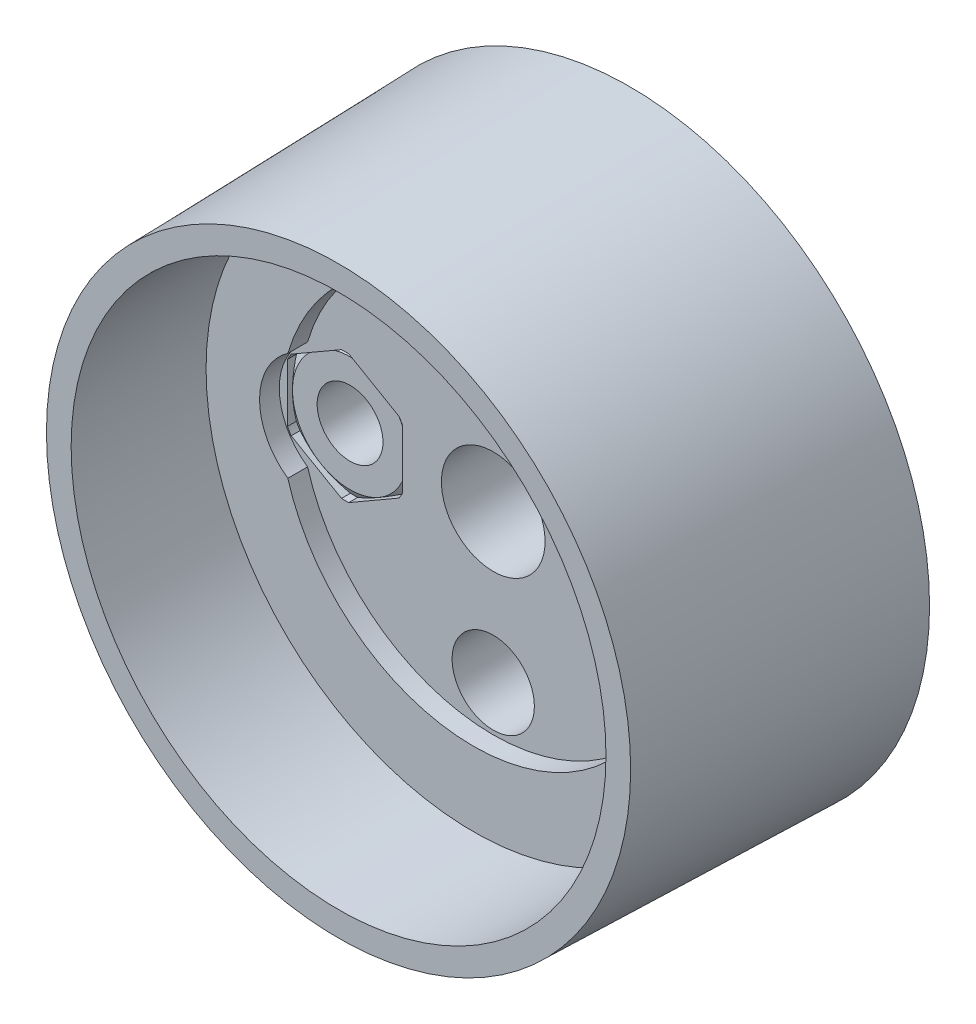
ISO-10303-21;
HEADER;
FILE_DESCRIPTION(('STEP AP214'),'2;1');
FILE_NAME('part.step','',(''),(''),'','','');
FILE_SCHEMA(('AUTOMOTIVE_DESIGN { 1 0 10303 214 1 1 1 1 }'));
ENDSEC;
DATA;
#1=APPLICATION_CONTEXT('core data for automotive mechanical design processes');
#2=APPLICATION_PROTOCOL_DEFINITION('international standard','automotive_design',2000,#1);
#3=PRODUCT_CONTEXT('',#1,'mechanical');
#4=PRODUCT('Part','Part','',(#3));
#5=PRODUCT_RELATED_PRODUCT_CATEGORY('part','',(#4));
#6=PRODUCT_DEFINITION_FORMATION('','',#4);
#7=PRODUCT_DEFINITION_CONTEXT('part definition',#1,'design');
#8=PRODUCT_DEFINITION('design','',#6,#7);
#9=PRODUCT_DEFINITION_SHAPE('','',#8);
#10=(LENGTH_UNIT() NAMED_UNIT(*) SI_UNIT(.MILLI.,.METRE.));
#11=(NAMED_UNIT(*) PLANE_ANGLE_UNIT() SI_UNIT($,.RADIAN.));
#12=(NAMED_UNIT(*) SI_UNIT($,.STERADIAN.) SOLID_ANGLE_UNIT());
#13=UNCERTAINTY_MEASURE_WITH_UNIT(LENGTH_MEASURE(1.E-05),#10,'distance_accuracy_value','');
#14=(GEOMETRIC_REPRESENTATION_CONTEXT(3) GLOBAL_UNCERTAINTY_ASSIGNED_CONTEXT((#13)) GLOBAL_UNIT_ASSIGNED_CONTEXT((#10,
#11,#12)) REPRESENTATION_CONTEXT('',''));
#15=CARTESIAN_POINT('',(0.,0.,0.));
#16=DIRECTION('',(0.,0.,1.));
#17=DIRECTION('',(1.,0.,0.));
#18=AXIS2_PLACEMENT_3D('',#15,#16,#17);
#19=CARTESIAN_POINT('',(-12.5,1.76533282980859,14.));
#20=DIRECTION('',(1.,0.,0.));
#21=DIRECTION('',(0.,0.,-1.));
#22=AXIS2_PLACEMENT_3D('',#19,#20,#21);
#23=PLANE('',#22);
#24=DIRECTION('',(0.,0.,-1.));
#25=VECTOR('',#24,1.);
#26=CARTESIAN_POINT('',(-12.5,-1.76533282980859,14.));
#27=LINE('',#26,#25);
#28=CARTESIAN_POINT('',(-12.5,-1.76533282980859,8.3));
#29=VERTEX_POINT('',#28);
#30=CARTESIAN_POINT('',(-12.5,-1.76533282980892,7.75751288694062));
#31=VERTEX_POINT('',#30);
#32=EDGE_CURVE('E569',#29,#31,#27,.T.);
#33=ORIENTED_EDGE('',*,*,#32,.T.);
#34=CARTESIAN_POINT('',(-12.5,-5.06373872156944,6.46678682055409));
#35=CARTESIAN_POINT('',(-12.5,-4.91533943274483,6.53724594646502));
#36=CARTESIAN_POINT('',(-12.5,-4.76656229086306,6.60692491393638));
#37=CARTESIAN_POINT('',(-12.5,-4.46805324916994,6.74428222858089));
#38=CARTESIAN_POINT('',(-12.5,-4.31832116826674,6.81196018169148));
#39=CARTESIAN_POINT('',(-12.5,-4.01684368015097,6.94525287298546));
#40=CARTESIAN_POINT('',(-12.5,-3.86509156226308,7.01085249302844));
#41=CARTESIAN_POINT('',(-12.5,-3.56027205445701,7.13890962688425));
#42=CARTESIAN_POINT('',(-12.5,-3.40720473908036,7.2013673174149));
#43=CARTESIAN_POINT('',(-12.5,-3.09863359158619,7.32265968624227));
#44=CARTESIAN_POINT('',(-12.5,-2.94312088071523,7.38147190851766));
#45=CARTESIAN_POINT('',(-12.5,-2.63022765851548,7.4939946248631));
#46=CARTESIAN_POINT('',(-12.5,-2.47284695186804,7.54770458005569));
#47=CARTESIAN_POINT('',(-12.5,-2.15636062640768,7.64848973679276));
#48=CARTESIAN_POINT('',(-12.5,-1.99725993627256,7.69558024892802));
#49=CARTESIAN_POINT('',(-12.5,-1.67686260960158,7.78154706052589));
#50=CARTESIAN_POINT('',(-12.5,-1.51556647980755,7.82042522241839));
#51=CARTESIAN_POINT('',(-12.5,-1.18612094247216,7.88901028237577));
#52=CARTESIAN_POINT('',(-12.5,-1.01790824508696,7.91841941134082));
#53=CARTESIAN_POINT('',(-12.5,-0.679692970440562,7.96443295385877));
#54=CARTESIAN_POINT('',(-12.5,-0.509690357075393,7.98103710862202));
#55=CARTESIAN_POINT('',(-12.5,-0.169663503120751,7.99997469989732));
#56=CARTESIAN_POINT('',(-12.5,0.000356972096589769,8.00237403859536));
#57=CARTESIAN_POINT('',(-12.5,0.339957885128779,7.99285268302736));
#58=CARTESIAN_POINT('',(-12.5,0.509538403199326,7.98093481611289));
#59=CARTESIAN_POINT('',(-12.5,0.805683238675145,7.94841341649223));
#60=CARTESIAN_POINT('',(-12.5,0.932574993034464,7.93066497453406));
#61=CARTESIAN_POINT('',(-12.5,1.1852391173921,7.88842040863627));
#62=CARTESIAN_POINT('',(-12.5,1.31101128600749,7.86392309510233));
#63=CARTESIAN_POINT('',(-12.5,1.6869159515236,7.78154723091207));
#64=CARTESIAN_POINT('',(-12.5,1.93512684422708,7.71484748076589));
#65=CARTESIAN_POINT('',(-12.5,2.30593797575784,7.60162990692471));
#66=CARTESIAN_POINT('',(-12.5,2.43051306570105,7.56122945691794));
#67=CARTESIAN_POINT('',(-12.5,2.67846287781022,7.4768357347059));
#68=CARTESIAN_POINT('',(-12.5,2.80183749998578,7.43284216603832));
#69=CARTESIAN_POINT('',(-12.5,3.04676500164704,7.34217034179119));
#70=CARTESIAN_POINT('',(-12.5,3.16832431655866,7.29550930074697));
#71=CARTESIAN_POINT('',(-12.5,3.41044301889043,7.19976733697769));
#72=CARTESIAN_POINT('',(-12.5,3.53100271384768,7.15068719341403));
#73=CARTESIAN_POINT('',(-12.5,3.65114658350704,7.10063054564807));
#74=B_SPLINE_CURVE_WITH_KNOTS('',3,(#34,#35,#36,#37,#38,#39,#40,#41,#42,#43,#44,#45,#46,#47,#48,
#49,#50,#51,#52,#53,#54,#55,#56,#57,#58,#59,#60,#61,#62,#63,#64,#65,#66,#67,#68,#69,#70,#71,#72,
#73),.UNSPECIFIED.,.F.,.F.,(4,2,2,2,2,2,2,2,2,2,2,2,2,2,2,2,2,2,2,4),(0.,0.492837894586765,
0.985772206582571,1.48171584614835,1.97763156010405,2.47634830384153,2.97511766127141,
3.47271369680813,3.97019676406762,4.48206790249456,4.99394938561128,5.50345416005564,
6.01285833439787,6.39704729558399,6.78130401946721,7.55135154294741,7.9442137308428,
8.33710836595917,8.72770413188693,9.11817490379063),.UNSPECIFIED.);
#75=CARTESIAN_POINT('',(-12.5,0.,8.));
#76=VERTEX_POINT('',#75);
#77=EDGE_CURVE('E480',#31,#76,#74,.T.);
#78=ORIENTED_EDGE('',*,*,#77,.T.);
#79=CARTESIAN_POINT('',(-12.5000000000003,1.76533282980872,7.75751288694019));
#80=VERTEX_POINT('',#79);
#81=EDGE_CURVE('E472',#76,#80,#74,.T.);
#82=ORIENTED_EDGE('',*,*,#81,.T.);
#83=DIRECTION('',(0.,0.,-1.));
#84=VECTOR('',#83,1.);
#85=CARTESIAN_POINT('',(-12.5,1.76533282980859,14.));
#86=LINE('',#85,#84);
#87=CARTESIAN_POINT('',(-12.5,1.76533282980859,8.3));
#88=VERTEX_POINT('',#87);
#89=EDGE_CURVE('E533',#88,#80,#86,.T.);
#90=ORIENTED_EDGE('',*,*,#89,.F.);
#91=DIRECTION('',(0.,1.,0.));
#92=VECTOR('',#91,1.);
#93=CARTESIAN_POINT('',(-12.5,3.15,8.3));
#94=LINE('',#93,#92);
#95=EDGE_CURVE('E737',#29,#88,#94,.T.);
#96=ORIENTED_EDGE('',*,*,#95,.F.);
#97=EDGE_LOOP('',(#33,#78,#82,#90,#96));
#98=FACE_BOUND('',#97,.T.);
#99=ADVANCED_FACE('F14',(#98),#23,.T.);
#100=CARTESIAN_POINT('',(-8.99999999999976,1.50053580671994E-13,14.));
#101=DIRECTION('',(0.,0.,-1.));
#102=DIRECTION('',(-1.,0.,0.));
#103=AXIS2_PLACEMENT_3D('',#100,#101,#102);
#104=CYLINDRICAL_SURFACE('',#103,3.92000000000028);
#105=DIRECTION('',(0.,0.,-1.));
#106=VECTOR('',#105,1.);
#107=CARTESIAN_POINT('',(-12.2788230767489,-2.14842249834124,14.));
#108=LINE('',#107,#106);
#109=CARTESIAN_POINT('',(-12.2788230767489,-2.14842249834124,8.3));
#110=VERTEX_POINT('',#109);
#111=CARTESIAN_POINT('',(-12.2788230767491,-2.14842249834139,7.7575128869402));
#112=VERTEX_POINT('',#111);
#113=EDGE_CURVE('E566',#110,#112,#108,.T.);
#114=ORIENTED_EDGE('',*,*,#113,.T.);
#115=CARTESIAN_POINT('',(-9.,0.,7.7575128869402));
#116=DIRECTION('',(0.,0.,-1.));
#117=DIRECTION('',(-1.,0.,0.));
#118=AXIS2_PLACEMENT_3D('',#115,#116,#117);
#119=CIRCLE('',#118,3.92000000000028);
#120=EDGE_CURVE('E495',#112,#31,#119,.T.);
#121=ORIENTED_EDGE('',*,*,#120,.T.);
#122=ORIENTED_EDGE('',*,*,#32,.F.);
#123=CARTESIAN_POINT('',(-8.99999999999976,1.50053580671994E-13,8.3));
#124=DIRECTION('',(0.,0.,1.));
#125=DIRECTION('',(1.,0.,0.));
#126=AXIS2_PLACEMENT_3D('',#123,#124,#125);
#127=CIRCLE('',#126,3.92000000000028);
#128=EDGE_CURVE('E734',#110,#29,#127,.F.);
#129=ORIENTED_EDGE('',*,*,#128,.F.);
#130=EDGE_LOOP('',(#114,#121,#122,#129));
#131=FACE_BOUND('',#130,.T.);
#132=ADVANCED_FACE('F459',(#131),#104,.F.);
#133=CARTESIAN_POINT('',(-12.2788230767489,-2.14842249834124,14.));
#134=DIRECTION('',(0.5,0.866025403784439,0.));
#135=DIRECTION('',(-0.866025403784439,0.5,0.));
#136=AXIS2_PLACEMENT_3D('',#133,#134,#135);
#137=PLANE('',#136);
#138=DIRECTION('',(0.,0.,-1.));
#139=VECTOR('',#138,1.);
#140=CARTESIAN_POINT('',(-9.22117692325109,-3.91375532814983,14.));
#141=LINE('',#140,#139);
#142=CARTESIAN_POINT('',(-9.22117692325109,-3.91375532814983,8.3));
#143=VERTEX_POINT('',#142);
#144=CARTESIAN_POINT('',(-9.22117692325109,-3.91375532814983,7.75751288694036));
#145=VERTEX_POINT('',#144);
#146=EDGE_CURVE('E563',#143,#145,#141,.T.);
#147=ORIENTED_EDGE('',*,*,#146,.T.);
#148=CARTESIAN_POINT('',(-9.22097692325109,-3.91387079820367,7.75745283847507));
#149=CARTESIAN_POINT('',(-9.29614832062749,-3.87047057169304,7.78002139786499));
#150=CARTESIAN_POINT('',(-9.37159814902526,-3.82690959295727,7.80135049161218));
#151=CARTESIAN_POINT('',(-9.52307099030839,-3.73945670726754,7.84122532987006));
#152=CARTESIAN_POINT('',(-9.59909417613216,-3.69556470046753,7.85977019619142));
#153=CARTESIAN_POINT('',(-9.82818318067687,-3.56330010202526,7.91079717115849));
#154=CARTESIAN_POINT('',(-9.98206519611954,-3.474456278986,7.93860895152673));
#155=CARTESIAN_POINT('',(-10.2879721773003,-3.29784080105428,7.97904770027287));
#156=CARTESIAN_POINT('',(-10.4399653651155,-3.2100874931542,7.99198996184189));
#157=CARTESIAN_POINT('',(-10.7442349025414,-3.03441739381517,8.00253005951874));
#158=CARTESIAN_POINT('',(-10.8965108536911,-2.94650083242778,8.0001422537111));
#159=CARTESIAN_POINT('',(-11.1515374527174,-2.7992611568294,7.98350174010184));
#160=CARTESIAN_POINT('',(-11.2545045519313,-2.73981307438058,7.97330106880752));
#161=CARTESIAN_POINT('',(-11.4598371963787,-2.6212642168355,7.94641300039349));
#162=CARTESIAN_POINT('',(-11.5622025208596,-2.56216356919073,7.92972335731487));
#163=CARTESIAN_POINT('',(-11.7676145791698,-2.44356886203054,7.8901844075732));
#164=CARTESIAN_POINT('',(-11.870648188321,-2.38408238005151,7.86724572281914));
#165=CARTESIAN_POINT('',(-12.0756414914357,-2.26572944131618,7.81610600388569));
#166=CARTESIAN_POINT('',(-12.1776020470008,-2.20686248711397,7.78790959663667));
#167=CARTESIAN_POINT('',(-12.2790230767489,-2.1483070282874,7.75745283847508));
#168=B_SPLINE_CURVE_WITH_KNOTS('',3,(#148,#149,#150,#151,#152,#153,#154,#155,#156,#157,#158,
#159,#160,#161,#162,#163,#164,#165,#166,#167),.UNSPECIFIED.,.F.,.F.,(4,2,2,2,2,2,2,2,2,4),(0.,
0.269043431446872,0.538171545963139,1.07715508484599,1.60448589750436,2.13132288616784,
2.48914897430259,2.84709902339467,3.21046504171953,3.57351278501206),.UNSPECIFIED.);
#169=CARTESIAN_POINT('',(-10.75,-3.03108891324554,8.));
#170=VERTEX_POINT('',#169);
#171=EDGE_CURVE('E247',#145,#170,#168,.T.);
#172=ORIENTED_EDGE('',*,*,#171,.T.);
#173=EDGE_CURVE('E274',#170,#112,#168,.T.);
#174=ORIENTED_EDGE('',*,*,#173,.T.);
#175=ORIENTED_EDGE('',*,*,#113,.F.);
#176=DIRECTION('',(-0.866025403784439,0.5,0.));
#177=VECTOR('',#176,1.);
#178=CARTESIAN_POINT('',(-5.36399001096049,-6.14070323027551,8.3));
#179=LINE('',#178,#177);
#180=EDGE_CURVE('E731',#143,#110,#179,.T.);
#181=ORIENTED_EDGE('',*,*,#180,.F.);
#182=EDGE_LOOP('',(#147,#172,#174,#175,#181));
#183=FACE_BOUND('',#182,.T.);
#184=ADVANCED_FACE('F465',(#183),#137,.T.);
#185=CARTESIAN_POINT('',(-9.,1.96891114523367E-13,14.));
#186=DIRECTION('',(0.,0.,-1.));
#187=DIRECTION('',(-1.,0.,0.));
#188=AXIS2_PLACEMENT_3D('',#185,#186,#187);
#189=CYLINDRICAL_SURFACE('',#188,3.92000000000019);
#190=DIRECTION('',(0.,0.,-1.));
#191=VECTOR('',#190,1.);
#192=CARTESIAN_POINT('',(-8.77882307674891,-3.91375532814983,14.));
#193=LINE('',#192,#191);
#194=CARTESIAN_POINT('',(-8.77882307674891,-3.91375532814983,8.3));
#195=VERTEX_POINT('',#194);
#196=CARTESIAN_POINT('',(-8.7788230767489,-3.91375532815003,7.75751288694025));
#197=VERTEX_POINT('',#196);
#198=EDGE_CURVE('E560',#195,#197,#193,.T.);
#199=ORIENTED_EDGE('',*,*,#198,.T.);
#200=CARTESIAN_POINT('',(-9.,0.,7.75751288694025));
#201=DIRECTION('',(0.,0.,-1.));
#202=DIRECTION('',(-1.,0.,0.));
#203=AXIS2_PLACEMENT_3D('',#200,#201,#202);
#204=CIRCLE('',#203,3.92000000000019);
#205=EDGE_CURVE('E319',#197,#145,#204,.T.);
#206=ORIENTED_EDGE('',*,*,#205,.T.);
#207=ORIENTED_EDGE('',*,*,#146,.F.);
#208=CARTESIAN_POINT('',(-9.,1.96891114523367E-13,8.3));
#209=DIRECTION('',(0.,0.,1.));
#210=DIRECTION('',(1.,0.,0.));
#211=AXIS2_PLACEMENT_3D('',#208,#209,#210);
#212=CIRCLE('',#211,3.92000000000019);
#213=EDGE_CURVE('E728',#195,#143,#212,.F.);
#214=ORIENTED_EDGE('',*,*,#213,.F.);
#215=EDGE_LOOP('',(#199,#206,#207,#214));
#216=FACE_BOUND('',#215,.T.);
#217=ADVANCED_FACE('F310',(#216),#189,.F.);
#218=CARTESIAN_POINT('',(-8.77882307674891,-3.91375532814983,14.));
#219=DIRECTION('',(-0.5,0.866025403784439,0.));
#220=DIRECTION('',(-0.866025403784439,-0.5,0.));
#221=AXIS2_PLACEMENT_3D('',#218,#219,#220);
#222=PLANE('',#221);
#223=DIRECTION('',(0.,0.,-1.));
#224=VECTOR('',#223,1.);
#225=CARTESIAN_POINT('',(-5.72117692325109,-2.14842249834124,14.));
#226=LINE('',#225,#224);
#227=CARTESIAN_POINT('',(-5.72117692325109,-2.14842249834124,8.3));
#228=VERTEX_POINT('',#227);
#229=CARTESIAN_POINT('',(-5.72117692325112,-2.14842249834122,7.75751288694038));
#230=VERTEX_POINT('',#229);
#231=EDGE_CURVE('E557',#228,#230,#226,.T.);
#232=ORIENTED_EDGE('',*,*,#231,.T.);
#233=CARTESIAN_POINT('',(-5.72097692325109,-2.1483070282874,7.75745283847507));
#234=CARTESIAN_POINT('',(-5.7961483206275,-2.19170725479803,7.78002139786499));
#235=CARTESIAN_POINT('',(-5.87159814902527,-2.23526823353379,7.80135049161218));
#236=CARTESIAN_POINT('',(-6.0230709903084,-2.32272111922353,7.84122532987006));
#237=CARTESIAN_POINT('',(-6.09909417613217,-2.36661312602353,7.85977019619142));
#238=CARTESIAN_POINT('',(-6.32818318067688,-2.49887772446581,7.91079717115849));
#239=CARTESIAN_POINT('',(-6.48206519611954,-2.58772154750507,7.93860895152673));
#240=CARTESIAN_POINT('',(-6.78797217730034,-2.76433702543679,7.97904770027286));
#241=CARTESIAN_POINT('',(-6.93996536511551,-2.85209033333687,7.99198996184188));
#242=CARTESIAN_POINT('',(-7.24423490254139,-3.0277604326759,8.00253005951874));
#243=CARTESIAN_POINT('',(-7.3965108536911,-3.11567699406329,8.00014225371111));
#244=CARTESIAN_POINT('',(-7.65153745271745,-3.26291666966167,7.98350174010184));
#245=CARTESIAN_POINT('',(-7.75450455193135,-3.32236475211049,7.97330106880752));
#246=CARTESIAN_POINT('',(-7.95983719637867,-3.44091360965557,7.94641300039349));
#247=CARTESIAN_POINT('',(-8.06220252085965,-3.50001425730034,7.92972335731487));
#248=CARTESIAN_POINT('',(-8.26761457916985,-3.61860896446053,7.8901844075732));
#249=CARTESIAN_POINT('',(-8.37064818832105,-3.67809544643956,7.86724572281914));
#250=CARTESIAN_POINT('',(-8.57564149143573,-3.79644838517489,7.81610600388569));
#251=CARTESIAN_POINT('',(-8.67760204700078,-3.8553153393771,7.78790959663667));
#252=CARTESIAN_POINT('',(-8.77902307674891,-3.91387079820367,7.75745283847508));
#253=B_SPLINE_CURVE_WITH_KNOTS('',3,(#233,#234,#235,#236,#237,#238,#239,#240,#241,#242,#243,
#244,#245,#246,#247,#248,#249,#250,#251,#252),.UNSPECIFIED.,.F.,.F.,(4,2,2,2,2,2,2,2,2,4),(0.,
0.269043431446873,0.538171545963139,1.07715508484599,1.60448589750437,2.13132288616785,
2.4891489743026,2.84709902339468,3.21046504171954,3.57351278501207),.UNSPECIFIED.);
#254=CARTESIAN_POINT('',(-7.25,-3.03108891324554,8.));
#255=VERTEX_POINT('',#254);
#256=EDGE_CURVE('E313',#230,#255,#253,.T.);
#257=ORIENTED_EDGE('',*,*,#256,.T.);
#258=EDGE_CURVE('E320',#255,#197,#253,.T.);
#259=ORIENTED_EDGE('',*,*,#258,.T.);
#260=ORIENTED_EDGE('',*,*,#198,.F.);
#261=DIRECTION('',(-0.866025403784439,-0.5,0.));
#262=VECTOR('',#261,1.);
#263=CARTESIAN_POINT('',(0.863990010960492,1.65352540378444,8.3));
#264=LINE('',#263,#262);
#265=EDGE_CURVE('E725',#228,#195,#264,.T.);
#266=ORIENTED_EDGE('',*,*,#265,.F.);
#267=EDGE_LOOP('',(#232,#257,#259,#260,#266));
#268=FACE_BOUND('',#267,.T.);
#269=ADVANCED_FACE('F305',(#268),#222,.T.);
#270=CARTESIAN_POINT('',(-9.,0.,14.));
#271=DIRECTION('',(0.,0.,-1.));
#272=DIRECTION('',(-1.,0.,0.));
#273=AXIS2_PLACEMENT_3D('',#270,#271,#272);
#274=CYLINDRICAL_SURFACE('',#273,3.92);
#275=DIRECTION('',(0.,0.,-1.));
#276=VECTOR('',#275,1.);
#277=CARTESIAN_POINT('',(-5.5,-1.76533282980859,14.));
#278=LINE('',#277,#276);
#279=CARTESIAN_POINT('',(-5.5,-1.76533282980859,8.3));
#280=VERTEX_POINT('',#279);
#281=CARTESIAN_POINT('',(-5.5,-1.76533282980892,7.75751288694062));
#282=VERTEX_POINT('',#281);
#283=EDGE_CURVE('E555',#280,#282,#278,.T.);
#284=ORIENTED_EDGE('',*,*,#283,.T.);
#285=CARTESIAN_POINT('',(-9.,0.,7.75751288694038));
#286=DIRECTION('',(0.,0.,-1.));
#287=DIRECTION('',(-1.,0.,0.));
#288=AXIS2_PLACEMENT_3D('',#285,#286,#287);
#289=CIRCLE('',#288,3.92);
#290=EDGE_CURVE('E242',#282,#230,#289,.T.);
#291=ORIENTED_EDGE('',*,*,#290,.T.);
#292=ORIENTED_EDGE('',*,*,#231,.F.);
#293=CARTESIAN_POINT('',(-9.,0.,8.3));
#294=DIRECTION('',(0.,0.,1.));
#295=DIRECTION('',(1.,0.,0.));
#296=AXIS2_PLACEMENT_3D('',#293,#294,#295);
#297=CIRCLE('',#296,3.92);
#298=EDGE_CURVE('E722',#280,#228,#297,.F.);
#299=ORIENTED_EDGE('',*,*,#298,.F.);
#300=EDGE_LOOP('',(#284,#291,#292,#299));
#301=FACE_BOUND('',#300,.T.);
#302=ADVANCED_FACE('F301',(#301),#274,.F.);
#303=CARTESIAN_POINT('',(-5.5,-1.76533282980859,14.));
#304=DIRECTION('',(-1.,0.,0.));
#305=DIRECTION('',(0.,0.,1.));
#306=AXIS2_PLACEMENT_3D('',#303,#304,#305);
#307=PLANE('',#306);
#308=DIRECTION('',(0.,0.,-1.));
#309=VECTOR('',#308,1.);
#310=CARTESIAN_POINT('',(-5.5,1.76533282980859,14.));
#311=LINE('',#310,#309);
#312=CARTESIAN_POINT('',(-5.5,1.76533282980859,8.3));
#313=VERTEX_POINT('',#312);
#314=CARTESIAN_POINT('',(-5.49999999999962,1.76533282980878,7.75751288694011));
#315=VERTEX_POINT('',#314);
#316=EDGE_CURVE('E273',#313,#315,#311,.T.);
#317=ORIENTED_EDGE('',*,*,#316,.T.);
#318=CARTESIAN_POINT('',(-5.5,-5.06373872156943,6.46678682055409));
#319=CARTESIAN_POINT('',(-5.5,-4.91533943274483,6.53724594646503));
#320=CARTESIAN_POINT('',(-5.5,-4.76656229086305,6.60692491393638));
#321=CARTESIAN_POINT('',(-5.5,-4.46805324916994,6.74428222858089));
#322=CARTESIAN_POINT('',(-5.5,-4.31832116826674,6.81196018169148));
#323=CARTESIAN_POINT('',(-5.5,-4.01684368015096,6.94525287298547));
#324=CARTESIAN_POINT('',(-5.5,-3.86509156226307,7.01085249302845));
#325=CARTESIAN_POINT('',(-5.5,-3.56027205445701,7.13890962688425));
#326=CARTESIAN_POINT('',(-5.5,-3.40720473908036,7.2013673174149));
#327=CARTESIAN_POINT('',(-5.5,-3.09863359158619,7.32265968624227));
#328=CARTESIAN_POINT('',(-5.5,-2.94312088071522,7.38147190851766));
#329=CARTESIAN_POINT('',(-5.5,-2.63022765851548,7.4939946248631));
#330=CARTESIAN_POINT('',(-5.5,-2.47284695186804,7.54770458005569));
#331=CARTESIAN_POINT('',(-5.5,-2.15636062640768,7.64848973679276));
#332=CARTESIAN_POINT('',(-5.5,-1.99725993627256,7.69558024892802));
#333=CARTESIAN_POINT('',(-5.5,-1.67686260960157,7.78154706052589));
#334=CARTESIAN_POINT('',(-5.5,-1.51556647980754,7.82042522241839));
#335=CARTESIAN_POINT('',(-5.5,-1.18612094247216,7.88901028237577));
#336=CARTESIAN_POINT('',(-5.5,-1.01790824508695,7.91841941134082));
#337=CARTESIAN_POINT('',(-5.5,-0.679692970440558,7.96443295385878));
#338=CARTESIAN_POINT('',(-5.5,-0.509690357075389,7.98103710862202));
#339=CARTESIAN_POINT('',(-5.5,-0.169663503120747,7.99997469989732));
#340=CARTESIAN_POINT('',(-5.5,0.000356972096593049,8.00237403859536));
#341=CARTESIAN_POINT('',(-5.5,0.339957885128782,7.99285268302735));
#342=CARTESIAN_POINT('',(-5.5,0.509538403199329,7.98093481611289));
#343=CARTESIAN_POINT('',(-5.5,0.805683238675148,7.94841341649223));
#344=CARTESIAN_POINT('',(-5.5,0.932574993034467,7.93066497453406));
#345=CARTESIAN_POINT('',(-5.5,1.1852391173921,7.88842040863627));
#346=CARTESIAN_POINT('',(-5.5,1.31101128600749,7.86392309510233));
#347=CARTESIAN_POINT('',(-5.5,1.6869159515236,7.78154723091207));
#348=CARTESIAN_POINT('',(-5.5,1.93512684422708,7.71484748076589));
#349=CARTESIAN_POINT('',(-5.5,2.30593797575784,7.60162990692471));
#350=CARTESIAN_POINT('',(-5.5,2.43051306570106,7.56122945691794));
#351=CARTESIAN_POINT('',(-5.5,2.67846287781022,7.4768357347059));
#352=CARTESIAN_POINT('',(-5.5,2.80183749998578,7.43284216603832));
#353=CARTESIAN_POINT('',(-5.5,3.04676500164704,7.34217034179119));
#354=CARTESIAN_POINT('',(-5.5,3.16832431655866,7.29550930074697));
#355=CARTESIAN_POINT('',(-5.5,3.41044301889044,7.19976733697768));
#356=CARTESIAN_POINT('',(-5.5,3.53100271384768,7.15068719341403));
#357=CARTESIAN_POINT('',(-5.5,3.65114658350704,7.10063054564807));
#358=B_SPLINE_CURVE_WITH_KNOTS('',3,(#318,#319,#320,#321,#322,#323,#324,#325,#326,#327,#328,
#329,#330,#331,#332,#333,#334,#335,#336,#337,#338,#339,#340,#341,#342,#343,#344,#345,#346,#347,
#348,#349,#350,#351,#352,#353,#354,#355,#356,#357),.UNSPECIFIED.,.F.,.F.,(4,2,2,2,2,2,2,2,2,2,2,
2,2,2,2,2,2,2,2,4),(0.,0.492837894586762,0.985772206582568,1.48171584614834,1.97763156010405,
2.47634830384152,2.9751176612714,3.47271369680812,3.97019676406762,4.48206790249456,
4.99394938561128,5.50345416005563,6.01285833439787,6.39704729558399,6.7813040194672,
7.55135154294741,7.9442137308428,8.33710836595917,8.72770413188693,9.11817490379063),.UNSPECIFIED.);
#359=CARTESIAN_POINT('',(-5.5,0.,8.));
#360=VERTEX_POINT('',#359);
#361=EDGE_CURVE('E249',#315,#360,#358,.F.);
#362=ORIENTED_EDGE('',*,*,#361,.T.);
#363=EDGE_CURVE('E236',#360,#282,#358,.F.);
#364=ORIENTED_EDGE('',*,*,#363,.T.);
#365=ORIENTED_EDGE('',*,*,#283,.F.);
#366=DIRECTION('',(0.,-1.,0.));
#367=VECTOR('',#366,1.);
#368=CARTESIAN_POINT('',(-5.5,3.15,8.3));
#369=LINE('',#368,#367);
#370=EDGE_CURVE('E719',#313,#280,#369,.T.);
#371=ORIENTED_EDGE('',*,*,#370,.F.);
#372=EDGE_LOOP('',(#317,#362,#364,#365,#371));
#373=FACE_BOUND('',#372,.T.);
#374=ADVANCED_FACE('F271',(#373),#307,.T.);
#375=CARTESIAN_POINT('',(-9.00000000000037,-2.22478285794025E-13,14.));
#376=DIRECTION('',(0.,0.,-1.));
#377=DIRECTION('',(-1.,0.,0.));
#378=AXIS2_PLACEMENT_3D('',#375,#376,#377);
#379=CYLINDRICAL_SURFACE('',#378,3.92000000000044);
#380=DIRECTION('',(0.,0.,-1.));
#381=VECTOR('',#380,1.);
#382=CARTESIAN_POINT('',(-5.72117692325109,2.14842249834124,14.));
#383=LINE('',#382,#381);
#384=CARTESIAN_POINT('',(-5.72117692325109,2.14842249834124,8.3));
#385=VERTEX_POINT('',#384);
#386=CARTESIAN_POINT('',(-5.72117692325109,2.14842249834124,7.75751288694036));
#387=VERTEX_POINT('',#386);
#388=EDGE_CURVE('E551',#385,#387,#383,.T.);
#389=ORIENTED_EDGE('',*,*,#388,.T.);
#390=CARTESIAN_POINT('',(-9.,0.,7.75751288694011));
#391=DIRECTION('',(0.,0.,-1.));
#392=DIRECTION('',(-1.,0.,0.));
#393=AXIS2_PLACEMENT_3D('',#390,#391,#392);
#394=CIRCLE('',#393,3.92000000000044);
#395=EDGE_CURVE('E275',#387,#315,#394,.T.);
#396=ORIENTED_EDGE('',*,*,#395,.T.);
#397=ORIENTED_EDGE('',*,*,#316,.F.);
#398=CARTESIAN_POINT('',(-9.00000000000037,-2.22478285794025E-13,8.3));
#399=DIRECTION('',(0.,0.,1.));
#400=DIRECTION('',(1.,0.,0.));
#401=AXIS2_PLACEMENT_3D('',#398,#399,#400);
#402=CIRCLE('',#401,3.92000000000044);
#403=EDGE_CURVE('E716',#385,#313,#402,.F.);
#404=ORIENTED_EDGE('',*,*,#403,.F.);
#405=EDGE_LOOP('',(#389,#396,#397,#404));
#406=FACE_BOUND('',#405,.T.);
#407=ADVANCED_FACE('F300',(#406),#379,.F.);
#408=CARTESIAN_POINT('',(-5.72117692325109,2.14842249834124,14.));
#409=DIRECTION('',(-0.5,-0.866025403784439,0.));
#410=DIRECTION('',(0.866025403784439,-0.5,0.));
#411=AXIS2_PLACEMENT_3D('',#408,#409,#410);
#412=PLANE('',#411);
#413=DIRECTION('',(0.,0.,-1.));
#414=VECTOR('',#413,1.);
#415=CARTESIAN_POINT('',(-8.77882307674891,3.91375532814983,14.));
#416=LINE('',#415,#414);
#417=CARTESIAN_POINT('',(-8.77882307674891,3.91375532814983,8.3));
#418=VERTEX_POINT('',#417);
#419=CARTESIAN_POINT('',(-8.77882307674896,3.91375532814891,7.75751288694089));
#420=VERTEX_POINT('',#419);
#421=EDGE_CURVE('E548',#418,#420,#416,.T.);
#422=ORIENTED_EDGE('',*,*,#421,.T.);
#423=CARTESIAN_POINT('',(-8.77902307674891,3.91387079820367,7.75745283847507));
#424=CARTESIAN_POINT('',(-8.70385167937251,3.87047057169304,7.78002139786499));
#425=CARTESIAN_POINT('',(-8.62840185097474,3.82690959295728,7.80135049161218));
#426=CARTESIAN_POINT('',(-8.47692900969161,3.73945670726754,7.84122532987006));
#427=CARTESIAN_POINT('',(-8.40090582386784,3.69556470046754,7.85977019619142));
#428=CARTESIAN_POINT('',(-8.17181681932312,3.56330010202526,7.91079717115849));
#429=CARTESIAN_POINT('',(-8.01793480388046,3.474456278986,7.93860895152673));
#430=CARTESIAN_POINT('',(-7.71202782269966,3.29784080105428,7.97904770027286));
#431=CARTESIAN_POINT('',(-7.56003463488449,3.2100874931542,7.99198996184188));
#432=CARTESIAN_POINT('',(-7.25576509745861,3.03441739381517,8.00253005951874));
#433=CARTESIAN_POINT('',(-7.1034891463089,2.94650083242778,8.00014225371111));
#434=CARTESIAN_POINT('',(-6.84846254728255,2.7992611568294,7.98350174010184));
#435=CARTESIAN_POINT('',(-6.74549544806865,2.73981307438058,7.97330106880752));
#436=CARTESIAN_POINT('',(-6.54016280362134,2.6212642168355,7.94641300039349));
#437=CARTESIAN_POINT('',(-6.43779747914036,2.56216356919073,7.92972335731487));
#438=CARTESIAN_POINT('',(-6.23238542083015,2.44356886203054,7.8901844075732));
#439=CARTESIAN_POINT('',(-6.12935181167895,2.38408238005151,7.86724572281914));
#440=CARTESIAN_POINT('',(-5.92435850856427,2.26572944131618,7.81610600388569));
#441=CARTESIAN_POINT('',(-5.82239795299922,2.20686248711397,7.78790959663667));
#442=CARTESIAN_POINT('',(-5.72097692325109,2.1483070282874,7.75745283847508));
#443=B_SPLINE_CURVE_WITH_KNOTS('',3,(#423,#424,#425,#426,#427,#428,#429,#430,#431,#432,#433,
#434,#435,#436,#437,#438,#439,#440,#441,#442),.UNSPECIFIED.,.F.,.F.,(4,2,2,2,2,2,2,2,2,4),(0.,
0.269043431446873,0.53817154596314,1.07715508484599,1.60448589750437,2.13132288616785,
2.4891489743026,2.84709902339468,3.21046504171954,3.57351278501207),.UNSPECIFIED.);
#444=CARTESIAN_POINT('',(-7.25,3.03108891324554,8.));
#445=VERTEX_POINT('',#444);
#446=EDGE_CURVE('E489',#420,#445,#443,.T.);
#447=ORIENTED_EDGE('',*,*,#446,.T.);
#448=EDGE_CURVE('E267',#445,#387,#443,.T.);
#449=ORIENTED_EDGE('',*,*,#448,.T.);
#450=ORIENTED_EDGE('',*,*,#388,.F.);
#451=DIRECTION('',(0.866025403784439,-0.5,0.));
#452=VECTOR('',#451,1.);
#453=CARTESIAN_POINT('',(-1.86399001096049,-0.0785254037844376,8.3));
#454=LINE('',#453,#452);
#455=EDGE_CURVE('E713',#418,#385,#454,.T.);
#456=ORIENTED_EDGE('',*,*,#455,.F.);
#457=EDGE_LOOP('',(#422,#447,#449,#450,#456));
#458=FACE_BOUND('',#457,.T.);
#459=ADVANCED_FACE('F496',(#458),#412,.T.);
#460=CARTESIAN_POINT('',(-9.,9.22872889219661E-13,14.));
#461=DIRECTION('',(0.,0.,-1.));
#462=DIRECTION('',(-1.,0.,0.));
#463=AXIS2_PLACEMENT_3D('',#460,#461,#462);
#464=CYLINDRICAL_SURFACE('',#463,3.91999999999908);
#465=DIRECTION('',(0.,0.,-1.));
#466=VECTOR('',#465,1.);
#467=CARTESIAN_POINT('',(-9.22117692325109,3.91375532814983,14.));
#468=LINE('',#467,#466);
#469=CARTESIAN_POINT('',(-9.22117692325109,3.91375532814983,8.3));
#470=VERTEX_POINT('',#469);
#471=CARTESIAN_POINT('',(-9.22117692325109,3.91375532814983,7.75751288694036));
#472=VERTEX_POINT('',#471);
#473=EDGE_CURVE('E545',#470,#472,#468,.T.);
#474=ORIENTED_EDGE('',*,*,#473,.T.);
#475=CARTESIAN_POINT('',(-9.,0.,7.75751288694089));
#476=DIRECTION('',(0.,0.,-1.));
#477=DIRECTION('',(-1.,0.,0.));
#478=AXIS2_PLACEMENT_3D('',#475,#476,#477);
#479=CIRCLE('',#478,3.91999999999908);
#480=EDGE_CURVE('E486',#472,#420,#479,.T.);
#481=ORIENTED_EDGE('',*,*,#480,.T.);
#482=ORIENTED_EDGE('',*,*,#421,.F.);
#483=CARTESIAN_POINT('',(-9.,9.22872889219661E-13,8.3));
#484=DIRECTION('',(0.,0.,1.));
#485=DIRECTION('',(1.,0.,0.));
#486=AXIS2_PLACEMENT_3D('',#483,#484,#485);
#487=CIRCLE('',#486,3.91999999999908);
#488=EDGE_CURVE('E710',#470,#418,#487,.F.);
#489=ORIENTED_EDGE('',*,*,#488,.F.);
#490=EDGE_LOOP('',(#474,#481,#482,#489));
#491=FACE_BOUND('',#490,.T.);
#492=ADVANCED_FACE('F500',(#491),#464,.F.);
#493=CARTESIAN_POINT('',(-9.22117692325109,3.91375532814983,14.));
#494=DIRECTION('',(0.5,-0.866025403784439,0.));
#495=DIRECTION('',(0.866025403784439,0.5,0.));
#496=AXIS2_PLACEMENT_3D('',#493,#494,#495);
#497=PLANE('',#496);
#498=DIRECTION('',(0.,0.,-1.));
#499=VECTOR('',#498,1.);
#500=CARTESIAN_POINT('',(-12.2788230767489,2.14842249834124,14.));
#501=LINE('',#500,#499);
#502=CARTESIAN_POINT('',(-12.2788230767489,2.14842249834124,8.3));
#503=VERTEX_POINT('',#502);
#504=CARTESIAN_POINT('',(-12.2788230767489,2.14842249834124,7.75751288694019));
#505=VERTEX_POINT('',#504);
#506=EDGE_CURVE('E542',#503,#505,#501,.T.);
#507=ORIENTED_EDGE('',*,*,#506,.T.);
#508=CARTESIAN_POINT('',(-12.2790230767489,2.1483070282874,7.75745283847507));
#509=CARTESIAN_POINT('',(-12.2038516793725,2.19170725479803,7.78002139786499));
#510=CARTESIAN_POINT('',(-12.1284018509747,2.2352682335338,7.80135049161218));
#511=CARTESIAN_POINT('',(-11.9769290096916,2.32272111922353,7.84122532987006));
#512=CARTESIAN_POINT('',(-11.9009058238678,2.36661312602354,7.85977019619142));
#513=CARTESIAN_POINT('',(-11.6718168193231,2.49887772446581,7.91079717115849));
#514=CARTESIAN_POINT('',(-11.5179348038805,2.58772154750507,7.93860895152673));
#515=CARTESIAN_POINT('',(-11.2120278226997,2.76433702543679,7.97904770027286));
#516=CARTESIAN_POINT('',(-11.0600346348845,2.85209033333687,7.99198996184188));
#517=CARTESIAN_POINT('',(-10.7557650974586,3.0277604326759,8.00253005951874));
#518=CARTESIAN_POINT('',(-10.6034891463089,3.11567699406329,8.00014225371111));
#519=CARTESIAN_POINT('',(-10.3484625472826,3.26291666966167,7.98350174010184));
#520=CARTESIAN_POINT('',(-10.2454954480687,3.32236475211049,7.97330106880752));
#521=CARTESIAN_POINT('',(-10.0401628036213,3.44091360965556,7.94641300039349));
#522=CARTESIAN_POINT('',(-9.93779747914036,3.50001425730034,7.92972335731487));
#523=CARTESIAN_POINT('',(-9.73238542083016,3.61860896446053,7.8901844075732));
#524=CARTESIAN_POINT('',(-9.62935181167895,3.67809544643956,7.86724572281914));
#525=CARTESIAN_POINT('',(-9.42435850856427,3.79644838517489,7.81610600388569));
#526=CARTESIAN_POINT('',(-9.32239795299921,3.8553153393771,7.78790959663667));
#527=CARTESIAN_POINT('',(-9.22097692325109,3.91387079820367,7.75745283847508));
#528=B_SPLINE_CURVE_WITH_KNOTS('',3,(#508,#509,#510,#511,#512,#513,#514,#515,#516,#517,#518,
#519,#520,#521,#522,#523,#524,#525,#526,#527),.UNSPECIFIED.,.F.,.F.,(4,2,2,2,2,2,2,2,2,4),(0.,
0.269043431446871,0.538171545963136,1.07715508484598,1.60448589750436,2.13132288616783,
2.48914897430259,2.84709902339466,3.21046504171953,3.57351278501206),.UNSPECIFIED.);
#529=CARTESIAN_POINT('',(-10.75,3.03108891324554,8.));
#530=VERTEX_POINT('',#529);
#531=EDGE_CURVE('E29',#505,#530,#528,.T.);
#532=ORIENTED_EDGE('',*,*,#531,.T.);
#533=EDGE_CURVE('E490',#530,#472,#528,.T.);
#534=ORIENTED_EDGE('',*,*,#533,.T.);
#535=ORIENTED_EDGE('',*,*,#473,.F.);
#536=DIRECTION('',(0.866025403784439,0.5,0.));
#537=VECTOR('',#536,1.);
#538=CARTESIAN_POINT('',(-2.6360099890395,7.71570323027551,8.3));
#539=LINE('',#538,#537);
#540=EDGE_CURVE('E707',#503,#470,#539,.T.);
#541=ORIENTED_EDGE('',*,*,#540,.F.);
#542=EDGE_LOOP('',(#507,#532,#534,#535,#541));
#543=FACE_BOUND('',#542,.T.);
#544=ADVANCED_FACE('F503',(#543),#497,.T.);
#545=CARTESIAN_POINT('',(-8.99999999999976,-1.54390389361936E-13,14.));
#546=DIRECTION('',(0.,0.,-1.));
#547=DIRECTION('',(-1.,0.,0.));
#548=AXIS2_PLACEMENT_3D('',#545,#546,#547);
#549=CYLINDRICAL_SURFACE('',#548,3.92000000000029);
#550=ORIENTED_EDGE('',*,*,#89,.T.);
#551=CARTESIAN_POINT('',(-9.,0.,7.75751288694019));
#552=DIRECTION('',(0.,0.,-1.));
#553=DIRECTION('',(-1.,0.,0.));
#554=AXIS2_PLACEMENT_3D('',#551,#552,#553);
#555=CIRCLE('',#554,3.92000000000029);
#556=EDGE_CURVE('E9',#80,#505,#555,.T.);
#557=ORIENTED_EDGE('',*,*,#556,.T.);
#558=ORIENTED_EDGE('',*,*,#506,.F.);
#559=CARTESIAN_POINT('',(-8.99999999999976,-1.54390389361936E-13,8.3));
#560=DIRECTION('',(0.,0.,1.));
#561=DIRECTION('',(1.,0.,0.));
#562=AXIS2_PLACEMENT_3D('',#559,#560,#561);
#563=CIRCLE('',#562,3.92000000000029);
#564=EDGE_CURVE('E704',#88,#503,#563,.F.);
#565=ORIENTED_EDGE('',*,*,#564,.F.);
#566=EDGE_LOOP('',(#550,#557,#558,#565));
#567=FACE_BOUND('',#566,.T.);
#568=ADVANCED_FACE('F405',(#567),#549,.F.);
#569=CARTESIAN_POINT('',(5.5,1.76533282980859,14.));
#570=DIRECTION('',(1.,0.,0.));
#571=DIRECTION('',(0.,0.,-1.));
#572=AXIS2_PLACEMENT_3D('',#569,#570,#571);
#573=PLANE('',#572);
#574=DIRECTION('',(0.,0.,-1.));
#575=VECTOR('',#574,1.);
#576=CARTESIAN_POINT('',(5.5,-1.76533282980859,14.));
#577=LINE('',#576,#575);
#578=CARTESIAN_POINT('',(5.5,-1.76533282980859,8.3));
#579=VERTEX_POINT('',#578);
#580=CARTESIAN_POINT('',(5.5,-1.76533282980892,7.75751288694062));
#581=VERTEX_POINT('',#580);
#582=EDGE_CURVE('E604',#579,#581,#577,.T.);
#583=ORIENTED_EDGE('',*,*,#582,.T.);
#584=CARTESIAN_POINT('',(5.5,-5.06373872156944,6.46678682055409));
#585=CARTESIAN_POINT('',(5.5,-4.91533943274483,6.53724594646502));
#586=CARTESIAN_POINT('',(5.5,-4.76656229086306,6.60692491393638));
#587=CARTESIAN_POINT('',(5.5,-4.46805324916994,6.74428222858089));
#588=CARTESIAN_POINT('',(5.5,-4.31832116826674,6.81196018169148));
#589=CARTESIAN_POINT('',(5.5,-4.01684368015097,6.94525287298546));
#590=CARTESIAN_POINT('',(5.5,-3.86509156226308,7.01085249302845));
#591=CARTESIAN_POINT('',(5.5,-3.56027205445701,7.13890962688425));
#592=CARTESIAN_POINT('',(5.5,-3.40720473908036,7.2013673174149));
#593=CARTESIAN_POINT('',(5.5,-3.09863359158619,7.32265968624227));
#594=CARTESIAN_POINT('',(5.5,-2.94312088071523,7.38147190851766));
#595=CARTESIAN_POINT('',(5.5,-2.63022765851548,7.4939946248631));
#596=CARTESIAN_POINT('',(5.5,-2.47284695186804,7.54770458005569));
#597=CARTESIAN_POINT('',(5.5,-2.15636062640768,7.64848973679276));
#598=CARTESIAN_POINT('',(5.5,-1.99725993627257,7.69558024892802));
#599=CARTESIAN_POINT('',(5.5,-1.67686260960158,7.78154706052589));
#600=CARTESIAN_POINT('',(5.5,-1.51556647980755,7.82042522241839));
#601=CARTESIAN_POINT('',(5.5,-1.18612094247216,7.88901028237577));
#602=CARTESIAN_POINT('',(5.5,-1.01790824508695,7.91841941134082));
#603=CARTESIAN_POINT('',(5.5,-0.67969297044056,7.96443295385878));
#604=CARTESIAN_POINT('',(5.5,-0.509690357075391,7.98103710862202));
#605=CARTESIAN_POINT('',(5.5,-0.169663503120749,7.99997469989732));
#606=CARTESIAN_POINT('',(5.5,0.000356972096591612,8.00237403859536));
#607=CARTESIAN_POINT('',(5.5,0.339957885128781,7.99285268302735));
#608=CARTESIAN_POINT('',(5.5,0.509538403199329,7.98093481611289));
#609=CARTESIAN_POINT('',(5.5,0.805683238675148,7.94841341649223));
#610=CARTESIAN_POINT('',(5.5,0.932574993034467,7.93066497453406));
#611=CARTESIAN_POINT('',(5.5,1.1852391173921,7.88842040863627));
#612=CARTESIAN_POINT('',(5.5,1.31101128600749,7.86392309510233));
#613=CARTESIAN_POINT('',(5.5,1.6869159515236,7.78154723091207));
#614=CARTESIAN_POINT('',(5.5,1.93512684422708,7.71484748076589));
#615=CARTESIAN_POINT('',(5.5,2.30593797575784,7.60162990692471));
#616=CARTESIAN_POINT('',(5.5,2.43051306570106,7.56122945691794));
#617=CARTESIAN_POINT('',(5.5,2.67846287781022,7.4768357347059));
#618=CARTESIAN_POINT('',(5.5,2.80183749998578,7.43284216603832));
#619=CARTESIAN_POINT('',(5.5,3.04676500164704,7.34217034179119));
#620=CARTESIAN_POINT('',(5.5,3.16832431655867,7.29550930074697));
#621=CARTESIAN_POINT('',(5.5,3.41044301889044,7.19976733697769));
#622=CARTESIAN_POINT('',(5.5,3.53100271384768,7.15068719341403));
#623=CARTESIAN_POINT('',(5.5,3.65114658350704,7.10063054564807));
#624=B_SPLINE_CURVE_WITH_KNOTS('',3,(#584,#585,#586,#587,#588,#589,#590,#591,#592,#593,#594,
#595,#596,#597,#598,#599,#600,#601,#602,#603,#604,#605,#606,#607,#608,#609,#610,#611,#612,#613,
#614,#615,#616,#617,#618,#619,#620,#621,#622,#623),.UNSPECIFIED.,.F.,.F.,(4,2,2,2,2,2,2,2,2,2,2,
2,2,2,2,2,2,2,2,4),(0.,0.492837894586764,0.985772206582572,1.48171584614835,1.97763156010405,
2.47634830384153,2.97511766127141,3.47271369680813,3.97019676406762,4.48206790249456,
4.99394938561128,5.50345416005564,6.01285833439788,6.397047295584,6.78130401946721,
7.55135154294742,7.94421373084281,8.33710836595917,8.72770413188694,9.11817490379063),.UNSPECIFIED.);
#625=CARTESIAN_POINT('',(5.5,0.,8.));
#626=VERTEX_POINT('',#625);
#627=EDGE_CURVE('E754',#581,#626,#624,.T.);
#628=ORIENTED_EDGE('',*,*,#627,.T.);
#629=CARTESIAN_POINT('',(5.5000000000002,1.76533282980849,7.75751288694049));
#630=VERTEX_POINT('',#629);
#631=EDGE_CURVE('E335',#626,#630,#624,.T.);
#632=ORIENTED_EDGE('',*,*,#631,.T.);
#633=DIRECTION('',(0.,0.,-1.));
#634=VECTOR('',#633,1.);
#635=CARTESIAN_POINT('',(5.5,1.76533282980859,14.));
#636=LINE('',#635,#634);
#637=CARTESIAN_POINT('',(5.5,1.76533282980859,8.3));
#638=VERTEX_POINT('',#637);
#639=EDGE_CURVE('E571',#638,#630,#636,.T.);
#640=ORIENTED_EDGE('',*,*,#639,.F.);
#641=DIRECTION('',(0.,1.,0.));
#642=VECTOR('',#641,1.);
#643=CARTESIAN_POINT('',(5.5,3.15,8.3));
#644=LINE('',#643,#642);
#645=EDGE_CURVE('E701',#579,#638,#644,.T.);
#646=ORIENTED_EDGE('',*,*,#645,.F.);
#647=EDGE_LOOP('',(#583,#628,#632,#640,#646));
#648=FACE_BOUND('',#647,.T.);
#649=ADVANCED_FACE('F400',(#648),#573,.T.);
#650=CARTESIAN_POINT('',(9.00000000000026,1.51137782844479E-13,14.));
#651=DIRECTION('',(0.,0.,-1.));
#652=DIRECTION('',(-1.,0.,0.));
#653=AXIS2_PLACEMENT_3D('',#650,#651,#652);
#654=CYLINDRICAL_SURFACE('',#653,3.9200000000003);
#655=DIRECTION('',(0.,0.,-1.));
#656=VECTOR('',#655,1.);
#657=CARTESIAN_POINT('',(5.72117692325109,-2.14842249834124,14.));
#658=LINE('',#657,#656);
#659=CARTESIAN_POINT('',(5.72117692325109,-2.14842249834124,8.3));
#660=VERTEX_POINT('',#659);
#661=CARTESIAN_POINT('',(5.72117692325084,-2.1484224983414,7.75751288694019));
#662=VERTEX_POINT('',#661);
#663=EDGE_CURVE('E601',#660,#662,#658,.T.);
#664=ORIENTED_EDGE('',*,*,#663,.T.);
#665=CARTESIAN_POINT('',(9.,0.,7.75751288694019));
#666=DIRECTION('',(0.,0.,-1.));
#667=DIRECTION('',(-1.,0.,0.));
#668=AXIS2_PLACEMENT_3D('',#665,#666,#667);
#669=CIRCLE('',#668,3.9200000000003);
#670=EDGE_CURVE('E761',#662,#581,#669,.T.);
#671=ORIENTED_EDGE('',*,*,#670,.T.);
#672=ORIENTED_EDGE('',*,*,#582,.F.);
#673=CARTESIAN_POINT('',(9.00000000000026,1.51137782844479E-13,8.3));
#674=DIRECTION('',(0.,0.,1.));
#675=DIRECTION('',(1.,0.,0.));
#676=AXIS2_PLACEMENT_3D('',#673,#674,#675);
#677=CIRCLE('',#676,3.9200000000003);
#678=EDGE_CURVE('E698',#660,#579,#677,.F.);
#679=ORIENTED_EDGE('',*,*,#678,.F.);
#680=EDGE_LOOP('',(#664,#671,#672,#679));
#681=FACE_BOUND('',#680,.T.);
#682=ADVANCED_FACE('F396',(#681),#654,.F.);
#683=CARTESIAN_POINT('',(5.72117692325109,-2.14842249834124,14.));
#684=DIRECTION('',(0.5,0.866025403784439,0.));
#685=DIRECTION('',(-0.866025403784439,0.5,0.));
#686=AXIS2_PLACEMENT_3D('',#683,#684,#685);
#687=PLANE('',#686);
#688=DIRECTION('',(0.,0.,-1.));
#689=VECTOR('',#688,1.);
#690=CARTESIAN_POINT('',(8.77882307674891,-3.91375532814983,14.));
#691=LINE('',#690,#689);
#692=CARTESIAN_POINT('',(8.77882307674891,-3.91375532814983,8.3));
#693=VERTEX_POINT('',#692);
#694=CARTESIAN_POINT('',(8.77882307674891,-3.91375532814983,7.75751288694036));
#695=VERTEX_POINT('',#694);
#696=EDGE_CURVE('E598',#693,#695,#691,.T.);
#697=ORIENTED_EDGE('',*,*,#696,.T.);
#698=CARTESIAN_POINT('',(8.77902307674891,-3.91387079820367,7.75745283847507));
#699=CARTESIAN_POINT('',(8.70385167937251,-3.87047057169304,7.78002139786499));
#700=CARTESIAN_POINT('',(8.62840185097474,-3.82690959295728,7.80135049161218));
#701=CARTESIAN_POINT('',(8.47692900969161,-3.73945670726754,7.84122532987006));
#702=CARTESIAN_POINT('',(8.40090582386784,-3.69556470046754,7.85977019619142));
#703=CARTESIAN_POINT('',(8.17181681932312,-3.56330010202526,7.91079717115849));
#704=CARTESIAN_POINT('',(8.01793480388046,-3.474456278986,7.93860895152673));
#705=CARTESIAN_POINT('',(7.71202782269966,-3.29784080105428,7.97904770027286));
#706=CARTESIAN_POINT('',(7.56003463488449,-3.2100874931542,7.99198996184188));
#707=CARTESIAN_POINT('',(7.25576509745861,-3.03441739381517,8.00253005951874));
#708=CARTESIAN_POINT('',(7.1034891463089,-2.94650083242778,8.00014225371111));
#709=CARTESIAN_POINT('',(6.84846254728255,-2.7992611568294,7.98350174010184));
#710=CARTESIAN_POINT('',(6.74549544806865,-2.73981307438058,7.97330106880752));
#711=CARTESIAN_POINT('',(6.54016280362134,-2.6212642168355,7.94641300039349));
#712=CARTESIAN_POINT('',(6.43779747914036,-2.56216356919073,7.92972335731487));
#713=CARTESIAN_POINT('',(6.23238542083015,-2.44356886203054,7.8901844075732));
#714=CARTESIAN_POINT('',(6.12935181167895,-2.38408238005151,7.86724572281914));
#715=CARTESIAN_POINT('',(5.92435850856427,-2.26572944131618,7.81610600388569));
#716=CARTESIAN_POINT('',(5.82239795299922,-2.20686248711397,7.78790959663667));
#717=CARTESIAN_POINT('',(5.72097692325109,-2.1483070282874,7.75745283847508));
#718=B_SPLINE_CURVE_WITH_KNOTS('',3,(#698,#699,#700,#701,#702,#703,#704,#705,#706,#707,#708,
#709,#710,#711,#712,#713,#714,#715,#716,#717),.UNSPECIFIED.,.F.,.F.,(4,2,2,2,2,2,2,2,2,4),(0.,
0.269043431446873,0.53817154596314,1.07715508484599,1.60448589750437,2.13132288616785,
2.4891489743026,2.84709902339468,3.21046504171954,3.57351278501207),.UNSPECIFIED.);
#719=CARTESIAN_POINT('',(7.25,-3.03108891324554,8.));
#720=VERTEX_POINT('',#719);
#721=EDGE_CURVE('E388',#695,#720,#718,.T.);
#722=ORIENTED_EDGE('',*,*,#721,.T.);
#723=EDGE_CURVE('E380',#720,#662,#718,.T.);
#724=ORIENTED_EDGE('',*,*,#723,.T.);
#725=ORIENTED_EDGE('',*,*,#663,.F.);
#726=DIRECTION('',(-0.866025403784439,0.5,0.));
#727=VECTOR('',#726,1.);
#728=CARTESIAN_POINT('',(-0.863990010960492,1.65352540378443,8.3));
#729=LINE('',#728,#727);
#730=EDGE_CURVE('E695',#693,#660,#729,.T.);
#731=ORIENTED_EDGE('',*,*,#730,.F.);
#732=EDGE_LOOP('',(#697,#722,#724,#725,#731));
#733=FACE_BOUND('',#732,.T.);
#734=ADVANCED_FACE('F390',(#733),#687,.T.);
#735=CARTESIAN_POINT('',(9.,-3.46077333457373E-13,14.));
#736=DIRECTION('',(0.,0.,-1.));
#737=DIRECTION('',(-1.,0.,0.));
#738=AXIS2_PLACEMENT_3D('',#735,#736,#737);
#739=CYLINDRICAL_SURFACE('',#738,3.91999999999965);
#740=DIRECTION('',(0.,0.,-1.));
#741=VECTOR('',#740,1.);
#742=CARTESIAN_POINT('',(9.22117692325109,-3.91375532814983,14.));
#743=LINE('',#742,#741);
#744=CARTESIAN_POINT('',(9.22117692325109,-3.91375532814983,8.3));
#745=VERTEX_POINT('',#744);
#746=CARTESIAN_POINT('',(9.22117692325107,-3.91375532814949,7.75751288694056));
#747=VERTEX_POINT('',#746);
#748=EDGE_CURVE('E595',#745,#747,#743,.T.);
#749=ORIENTED_EDGE('',*,*,#748,.T.);
#750=CARTESIAN_POINT('',(9.,0.,7.75751288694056));
#751=DIRECTION('',(0.,0.,-1.));
#752=DIRECTION('',(-1.,0.,0.));
#753=AXIS2_PLACEMENT_3D('',#750,#751,#752);
#754=CIRCLE('',#753,3.91999999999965);
#755=EDGE_CURVE('E536',#747,#695,#754,.T.);
#756=ORIENTED_EDGE('',*,*,#755,.T.);
#757=ORIENTED_EDGE('',*,*,#696,.F.);
#758=CARTESIAN_POINT('',(9.,-3.46077333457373E-13,8.3));
#759=DIRECTION('',(0.,0.,1.));
#760=DIRECTION('',(1.,0.,0.));
#761=AXIS2_PLACEMENT_3D('',#758,#759,#760);
#762=CIRCLE('',#761,3.91999999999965);
#763=EDGE_CURVE('E692',#745,#693,#762,.F.);
#764=ORIENTED_EDGE('',*,*,#763,.F.);
#765=EDGE_LOOP('',(#749,#756,#757,#764));
#766=FACE_BOUND('',#765,.T.);
#767=ADVANCED_FACE('F395',(#766),#739,.F.);
#768=CARTESIAN_POINT('',(9.22117692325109,-3.91375532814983,14.));
#769=DIRECTION('',(-0.5,0.866025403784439,0.));
#770=DIRECTION('',(-0.866025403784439,-0.5,0.));
#771=AXIS2_PLACEMENT_3D('',#768,#769,#770);
#772=PLANE('',#771);
#773=DIRECTION('',(0.,0.,-1.));
#774=VECTOR('',#773,1.);
#775=CARTESIAN_POINT('',(12.2788230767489,-2.14842249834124,14.));
#776=LINE('',#775,#774);
#777=CARTESIAN_POINT('',(12.2788230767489,-2.14842249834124,8.3));
#778=VERTEX_POINT('',#777);
#779=CARTESIAN_POINT('',(12.278823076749,-2.14842249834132,7.75751288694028));
#780=VERTEX_POINT('',#779);
#781=EDGE_CURVE('E592',#778,#780,#776,.T.);
#782=ORIENTED_EDGE('',*,*,#781,.T.);
#783=CARTESIAN_POINT('',(12.2790230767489,-2.1483070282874,7.75745283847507));
#784=CARTESIAN_POINT('',(12.2038516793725,-2.19170725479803,7.78002139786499));
#785=CARTESIAN_POINT('',(12.1284018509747,-2.2352682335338,7.80135049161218));
#786=CARTESIAN_POINT('',(11.9769290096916,-2.32272111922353,7.84122532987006));
#787=CARTESIAN_POINT('',(11.9009058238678,-2.36661312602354,7.85977019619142));
#788=CARTESIAN_POINT('',(11.6718168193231,-2.49887772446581,7.91079717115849));
#789=CARTESIAN_POINT('',(11.5179348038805,-2.58772154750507,7.93860895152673));
#790=CARTESIAN_POINT('',(11.2120278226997,-2.76433702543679,7.97904770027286));
#791=CARTESIAN_POINT('',(11.0600346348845,-2.85209033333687,7.99198996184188));
#792=CARTESIAN_POINT('',(10.7557650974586,-3.0277604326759,8.00253005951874));
#793=CARTESIAN_POINT('',(10.6034891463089,-3.11567699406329,8.00014225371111));
#794=CARTESIAN_POINT('',(10.3484625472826,-3.26291666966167,7.98350174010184));
#795=CARTESIAN_POINT('',(10.2454954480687,-3.32236475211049,7.97330106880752));
#796=CARTESIAN_POINT('',(10.0401628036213,-3.44091360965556,7.94641300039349));
#797=CARTESIAN_POINT('',(9.93779747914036,-3.50001425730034,7.92972335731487));
#798=CARTESIAN_POINT('',(9.73238542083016,-3.61860896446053,7.8901844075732));
#799=CARTESIAN_POINT('',(9.62935181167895,-3.67809544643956,7.86724572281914));
#800=CARTESIAN_POINT('',(9.42435850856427,-3.79644838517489,7.81610600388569));
#801=CARTESIAN_POINT('',(9.32239795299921,-3.8553153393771,7.78790959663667));
#802=CARTESIAN_POINT('',(9.22097692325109,-3.91387079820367,7.75745283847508));
#803=B_SPLINE_CURVE_WITH_KNOTS('',3,(#783,#784,#785,#786,#787,#788,#789,#790,#791,#792,#793,
#794,#795,#796,#797,#798,#799,#800,#801,#802),.UNSPECIFIED.,.F.,.F.,(4,2,2,2,2,2,2,2,2,4),(0.,
0.269043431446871,0.538171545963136,1.07715508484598,1.60448589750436,2.13132288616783,
2.48914897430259,2.84709902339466,3.21046504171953,3.57351278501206),.UNSPECIFIED.);
#804=CARTESIAN_POINT('',(10.75,-3.03108891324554,8.));
#805=VERTEX_POINT('',#804);
#806=EDGE_CURVE('E537',#780,#805,#803,.T.);
#807=ORIENTED_EDGE('',*,*,#806,.T.);
#808=EDGE_CURVE('E530',#805,#747,#803,.T.);
#809=ORIENTED_EDGE('',*,*,#808,.T.);
#810=ORIENTED_EDGE('',*,*,#748,.F.);
#811=DIRECTION('',(-0.866025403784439,-0.5,0.));
#812=VECTOR('',#811,1.);
#813=CARTESIAN_POINT('',(5.36399001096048,-6.14070323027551,8.3));
#814=LINE('',#813,#812);
#815=EDGE_CURVE('E689',#778,#745,#814,.T.);
#816=ORIENTED_EDGE('',*,*,#815,.F.);
#817=EDGE_LOOP('',(#782,#807,#809,#810,#816));
#818=FACE_BOUND('',#817,.T.);
#819=ADVANCED_FACE('F794',(#818),#772,.T.);
#820=CARTESIAN_POINT('',(8.99999999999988,0.,14.));
#821=DIRECTION('',(0.,0.,-1.));
#822=DIRECTION('',(-1.,0.,0.));
#823=AXIS2_PLACEMENT_3D('',#820,#821,#822);
#824=CYLINDRICAL_SURFACE('',#823,3.92000000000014);
#825=DIRECTION('',(0.,0.,-1.));
#826=VECTOR('',#825,1.);
#827=CARTESIAN_POINT('',(12.5,-1.76533282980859,14.));
#828=LINE('',#827,#826);
#829=CARTESIAN_POINT('',(12.5,-1.76533282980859,8.3));
#830=VERTEX_POINT('',#829);
#831=CARTESIAN_POINT('',(12.5,-1.76533282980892,7.75751288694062));
#832=VERTEX_POINT('',#831);
#833=EDGE_CURVE('E589',#830,#832,#828,.T.);
#834=ORIENTED_EDGE('',*,*,#833,.T.);
#835=CARTESIAN_POINT('',(9.,0.,7.75751288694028));
#836=DIRECTION('',(0.,0.,-1.));
#837=DIRECTION('',(-1.,0.,0.));
#838=AXIS2_PLACEMENT_3D('',#835,#836,#837);
#839=CIRCLE('',#838,3.92000000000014);
#840=EDGE_CURVE('E389',#832,#780,#839,.T.);
#841=ORIENTED_EDGE('',*,*,#840,.T.);
#842=ORIENTED_EDGE('',*,*,#781,.F.);
#843=CARTESIAN_POINT('',(8.99999999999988,0.,8.3));
#844=DIRECTION('',(0.,0.,1.));
#845=DIRECTION('',(1.,0.,0.));
#846=AXIS2_PLACEMENT_3D('',#843,#844,#845);
#847=CIRCLE('',#846,3.92000000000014);
#848=EDGE_CURVE('E686',#830,#778,#847,.F.);
#849=ORIENTED_EDGE('',*,*,#848,.F.);
#850=EDGE_LOOP('',(#834,#841,#842,#849));
#851=FACE_BOUND('',#850,.T.);
#852=ADVANCED_FACE('F798',(#851),#824,.F.);
#853=CARTESIAN_POINT('',(12.5,-1.76533282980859,14.));
#854=DIRECTION('',(-1.,0.,0.));
#855=DIRECTION('',(0.,0.,1.));
#856=AXIS2_PLACEMENT_3D('',#853,#854,#855);
#857=PLANE('',#856);
#858=DIRECTION('',(0.,0.,-1.));
#859=VECTOR('',#858,1.);
#860=CARTESIAN_POINT('',(12.5,1.76533282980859,14.));
#861=LINE('',#860,#859);
#862=CARTESIAN_POINT('',(12.5,1.76533282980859,8.3));
#863=VERTEX_POINT('',#862);
#864=CARTESIAN_POINT('',(12.5,1.7653328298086,7.75751288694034));
#865=VERTEX_POINT('',#864);
#866=EDGE_CURVE('E586',#863,#865,#861,.T.);
#867=ORIENTED_EDGE('',*,*,#866,.T.);
#868=CARTESIAN_POINT('',(12.5,-5.06373872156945,6.46678682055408));
#869=CARTESIAN_POINT('',(12.5,-4.91533943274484,6.53724594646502));
#870=CARTESIAN_POINT('',(12.5,-4.76656229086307,6.60692491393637));
#871=CARTESIAN_POINT('',(12.5,-4.46805324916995,6.74428222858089));
#872=CARTESIAN_POINT('',(12.5,-4.31832116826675,6.81196018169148));
#873=CARTESIAN_POINT('',(12.5,-4.01684368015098,6.94525287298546));
#874=CARTESIAN_POINT('',(12.5,-3.86509156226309,7.01085249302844));
#875=CARTESIAN_POINT('',(12.5,-3.56027205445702,7.13890962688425));
#876=CARTESIAN_POINT('',(12.5,-3.40720473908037,7.2013673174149));
#877=CARTESIAN_POINT('',(12.5,-3.0986335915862,7.32265968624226));
#878=CARTESIAN_POINT('',(12.5,-2.94312088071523,7.38147190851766));
#879=CARTESIAN_POINT('',(12.5,-2.63022765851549,7.49399462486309));
#880=CARTESIAN_POINT('',(12.5,-2.47284695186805,7.54770458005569));
#881=CARTESIAN_POINT('',(12.5,-2.15636062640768,7.64848973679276));
#882=CARTESIAN_POINT('',(12.5,-1.99725993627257,7.69558024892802));
#883=CARTESIAN_POINT('',(12.5,-1.67686260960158,7.78154706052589));
#884=CARTESIAN_POINT('',(12.5,-1.51556647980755,7.82042522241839));
#885=CARTESIAN_POINT('',(12.5,-1.18612094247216,7.88901028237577));
#886=CARTESIAN_POINT('',(12.5,-1.01790824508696,7.91841941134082));
#887=CARTESIAN_POINT('',(12.5,-0.679692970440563,7.96443295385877));
#888=CARTESIAN_POINT('',(12.5,-0.509690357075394,7.98103710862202));
#889=CARTESIAN_POINT('',(12.5,-0.169663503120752,7.99997469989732));
#890=CARTESIAN_POINT('',(12.5,0.000356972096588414,8.00237403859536));
#891=CARTESIAN_POINT('',(12.5,0.339957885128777,7.99285268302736));
#892=CARTESIAN_POINT('',(12.5,0.509538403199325,7.98093481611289));
#893=CARTESIAN_POINT('',(12.5,0.805683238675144,7.94841341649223));
#894=CARTESIAN_POINT('',(12.5,0.932574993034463,7.93066497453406));
#895=CARTESIAN_POINT('',(12.5,1.1852391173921,7.88842040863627));
#896=CARTESIAN_POINT('',(12.5,1.31101128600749,7.86392309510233));
#897=CARTESIAN_POINT('',(12.5,1.6869159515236,7.78154723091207));
#898=CARTESIAN_POINT('',(12.5,1.93512684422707,7.71484748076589));
#899=CARTESIAN_POINT('',(12.5,2.30593797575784,7.60162990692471));
#900=CARTESIAN_POINT('',(12.5,2.43051306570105,7.56122945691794));
#901=CARTESIAN_POINT('',(12.5,2.67846287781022,7.4768357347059));
#902=CARTESIAN_POINT('',(12.5,2.80183749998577,7.43284216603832));
#903=CARTESIAN_POINT('',(12.5,3.04676500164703,7.34217034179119));
#904=CARTESIAN_POINT('',(12.5,3.16832431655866,7.29550930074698));
#905=CARTESIAN_POINT('',(12.5,3.41044301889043,7.19976733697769));
#906=CARTESIAN_POINT('',(12.5,3.53100271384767,7.15068719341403));
#907=CARTESIAN_POINT('',(12.5,3.65114658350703,7.10063054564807));
#908=B_SPLINE_CURVE_WITH_KNOTS('',3,(#868,#869,#870,#871,#872,#873,#874,#875,#876,#877,#878,
#879,#880,#881,#882,#883,#884,#885,#886,#887,#888,#889,#890,#891,#892,#893,#894,#895,#896,#897,
#898,#899,#900,#901,#902,#903,#904,#905,#906,#907),.UNSPECIFIED.,.F.,.F.,(4,2,2,2,2,2,2,2,2,2,2,
2,2,2,2,2,2,2,2,4),(0.,0.492837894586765,0.985772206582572,1.48171584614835,1.97763156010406,
2.47634830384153,2.97511766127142,3.47271369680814,3.97019676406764,4.48206790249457,
4.99394938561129,5.50345416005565,6.01285833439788,6.397047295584,6.78130401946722,
7.55135154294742,7.94421373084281,8.33710836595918,8.72770413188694,9.11817490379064),.UNSPECIFIED.);
#909=CARTESIAN_POINT('',(12.5,0.,8.));
#910=VERTEX_POINT('',#909);
#911=EDGE_CURVE('E372',#865,#910,#908,.F.);
#912=ORIENTED_EDGE('',*,*,#911,.T.);
#913=EDGE_CURVE('E772',#910,#832,#908,.F.);
#914=ORIENTED_EDGE('',*,*,#913,.T.);
#915=ORIENTED_EDGE('',*,*,#833,.F.);
#916=DIRECTION('',(0.,-1.,0.));
#917=VECTOR('',#916,1.);
#918=CARTESIAN_POINT('',(12.5,3.15,8.3));
#919=LINE('',#918,#917);
#920=EDGE_CURVE('E683',#863,#830,#919,.T.);
#921=ORIENTED_EDGE('',*,*,#920,.F.);
#922=EDGE_LOOP('',(#867,#912,#914,#915,#921));
#923=FACE_BOUND('',#922,.T.);
#924=ADVANCED_FACE('F800',(#923),#857,.T.);
#925=CARTESIAN_POINT('',(9.,0.,14.));
#926=DIRECTION('',(0.,0.,-1.));
#927=DIRECTION('',(-1.,0.,0.));
#928=AXIS2_PLACEMENT_3D('',#925,#926,#927);
#929=CYLINDRICAL_SURFACE('',#928,3.92);
#930=DIRECTION('',(0.,0.,-1.));
#931=VECTOR('',#930,1.);
#932=CARTESIAN_POINT('',(12.2788230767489,2.14842249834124,14.));
#933=LINE('',#932,#931);
#934=CARTESIAN_POINT('',(12.2788230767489,2.14842249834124,8.3));
#935=VERTEX_POINT('',#934);
#936=CARTESIAN_POINT('',(12.2788230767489,2.14842249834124,7.75751288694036));
#937=VERTEX_POINT('',#936);
#938=EDGE_CURVE('E583',#935,#937,#933,.T.);
#939=ORIENTED_EDGE('',*,*,#938,.T.);
#940=CARTESIAN_POINT('',(9.,0.,7.75751288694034));
#941=DIRECTION('',(0.,0.,-1.));
#942=DIRECTION('',(-1.,0.,0.));
#943=AXIS2_PLACEMENT_3D('',#940,#941,#942);
#944=CIRCLE('',#943,3.92);
#945=EDGE_CURVE('E766',#937,#865,#944,.T.);
#946=ORIENTED_EDGE('',*,*,#945,.T.);
#947=ORIENTED_EDGE('',*,*,#866,.F.);
#948=CARTESIAN_POINT('',(9.,0.,8.3));
#949=DIRECTION('',(0.,0.,1.));
#950=DIRECTION('',(1.,0.,0.));
#951=AXIS2_PLACEMENT_3D('',#948,#949,#950);
#952=CIRCLE('',#951,3.92);
#953=EDGE_CURVE('E680',#935,#863,#952,.F.);
#954=ORIENTED_EDGE('',*,*,#953,.F.);
#955=EDGE_LOOP('',(#939,#946,#947,#954));
#956=FACE_BOUND('',#955,.T.);
#957=ADVANCED_FACE('F805',(#956),#929,.F.);
#958=CARTESIAN_POINT('',(12.2788230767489,2.14842249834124,14.));
#959=DIRECTION('',(-0.5,-0.866025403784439,0.));
#960=DIRECTION('',(0.866025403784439,-0.5,0.));
#961=AXIS2_PLACEMENT_3D('',#958,#959,#960);
#962=PLANE('',#961);
#963=DIRECTION('',(0.,0.,-1.));
#964=VECTOR('',#963,1.);
#965=CARTESIAN_POINT('',(9.22117692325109,3.91375532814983,14.));
#966=LINE('',#965,#964);
#967=CARTESIAN_POINT('',(9.22117692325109,3.91375532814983,8.3));
#968=VERTEX_POINT('',#967);
#969=CARTESIAN_POINT('',(9.22117692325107,3.91375532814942,7.75751288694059));
#970=VERTEX_POINT('',#969);
#971=EDGE_CURVE('E580',#968,#970,#966,.T.);
#972=ORIENTED_EDGE('',*,*,#971,.T.);
#973=CARTESIAN_POINT('',(9.22097692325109,3.91387079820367,7.75745283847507));
#974=CARTESIAN_POINT('',(9.29614832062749,3.87047057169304,7.78002139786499));
#975=CARTESIAN_POINT('',(9.37159814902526,3.82690959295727,7.80135049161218));
#976=CARTESIAN_POINT('',(9.52307099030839,3.73945670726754,7.84122532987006));
#977=CARTESIAN_POINT('',(9.59909417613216,3.69556470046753,7.85977019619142));
#978=CARTESIAN_POINT('',(9.82818318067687,3.56330010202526,7.91079717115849));
#979=CARTESIAN_POINT('',(9.98206519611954,3.474456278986,7.93860895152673));
#980=CARTESIAN_POINT('',(10.2879721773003,3.29784080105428,7.97904770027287));
#981=CARTESIAN_POINT('',(10.4399653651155,3.2100874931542,7.99198996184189));
#982=CARTESIAN_POINT('',(10.7442349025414,3.03441739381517,8.00253005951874));
#983=CARTESIAN_POINT('',(10.8965108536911,2.94650083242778,8.0001422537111));
#984=CARTESIAN_POINT('',(11.1515374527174,2.7992611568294,7.98350174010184));
#985=CARTESIAN_POINT('',(11.2545045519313,2.73981307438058,7.97330106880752));
#986=CARTESIAN_POINT('',(11.4598371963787,2.6212642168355,7.94641300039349));
#987=CARTESIAN_POINT('',(11.5622025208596,2.56216356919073,7.92972335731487));
#988=CARTESIAN_POINT('',(11.7676145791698,2.44356886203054,7.8901844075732));
#989=CARTESIAN_POINT('',(11.870648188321,2.38408238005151,7.86724572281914));
#990=CARTESIAN_POINT('',(12.0756414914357,2.26572944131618,7.81610600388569));
#991=CARTESIAN_POINT('',(12.1776020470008,2.20686248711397,7.78790959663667));
#992=CARTESIAN_POINT('',(12.2790230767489,2.1483070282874,7.75745283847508));
#993=B_SPLINE_CURVE_WITH_KNOTS('',3,(#973,#974,#975,#976,#977,#978,#979,#980,#981,#982,#983,
#984,#985,#986,#987,#988,#989,#990,#991,#992),.UNSPECIFIED.,.F.,.F.,(4,2,2,2,2,2,2,2,2,4),(0.,
0.269043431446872,0.538171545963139,1.07715508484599,1.60448589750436,2.13132288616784,
2.48914897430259,2.84709902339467,3.21046504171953,3.57351278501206),.UNSPECIFIED.);
#994=CARTESIAN_POINT('',(10.75,3.03108891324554,8.));
#995=VERTEX_POINT('',#994);
#996=EDGE_CURVE('E364',#970,#995,#993,.T.);
#997=ORIENTED_EDGE('',*,*,#996,.T.);
#998=EDGE_CURVE('E762',#995,#937,#993,.T.);
#999=ORIENTED_EDGE('',*,*,#998,.T.);
#1000=ORIENTED_EDGE('',*,*,#938,.F.);
#1001=DIRECTION('',(0.866025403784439,-0.5,0.));
#1002=VECTOR('',#1001,1.);
#1003=CARTESIAN_POINT('',(2.63600998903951,7.71570323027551,8.3));
#1004=LINE('',#1003,#1002);
#1005=EDGE_CURVE('E677',#968,#935,#1004,.T.);
#1006=ORIENTED_EDGE('',*,*,#1005,.F.);
#1007=EDGE_LOOP('',(#972,#997,#999,#1000,#1006));
#1008=FACE_BOUND('',#1007,.T.);
#1009=ADVANCED_FACE('F807',(#1008),#962,.T.);
#1010=CARTESIAN_POINT('',(9.,4.09394740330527E-13,14.));
#1011=DIRECTION('',(0.,0.,-1.));
#1012=DIRECTION('',(-1.,0.,0.));
#1013=AXIS2_PLACEMENT_3D('',#1010,#1011,#1012);
#1014=CYLINDRICAL_SURFACE('',#1013,3.91999999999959);
#1015=DIRECTION('',(0.,0.,-1.));
#1016=VECTOR('',#1015,1.);
#1017=CARTESIAN_POINT('',(8.77882307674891,3.91375532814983,14.));
#1018=LINE('',#1017,#1016);
#1019=CARTESIAN_POINT('',(8.77882307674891,3.91375532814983,8.3));
#1020=VERTEX_POINT('',#1019);
#1021=CARTESIAN_POINT('',(8.77882307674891,3.91375532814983,7.75751288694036));
#1022=VERTEX_POINT('',#1021);
#1023=EDGE_CURVE('E577',#1020,#1022,#1018,.T.);
#1024=ORIENTED_EDGE('',*,*,#1023,.T.);
#1025=CARTESIAN_POINT('',(9.,0.,7.75751288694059));
#1026=DIRECTION('',(0.,0.,-1.));
#1027=DIRECTION('',(-1.,0.,0.));
#1028=AXIS2_PLACEMENT_3D('',#1025,#1026,#1027);
#1029=CIRCLE('',#1028,3.91999999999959);
#1030=EDGE_CURVE('E756',#1022,#970,#1029,.T.);
#1031=ORIENTED_EDGE('',*,*,#1030,.T.);
#1032=ORIENTED_EDGE('',*,*,#971,.F.);
#1033=CARTESIAN_POINT('',(9.,4.09394740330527E-13,8.3));
#1034=DIRECTION('',(0.,0.,1.));
#1035=DIRECTION('',(1.,0.,0.));
#1036=AXIS2_PLACEMENT_3D('',#1033,#1034,#1035);
#1037=CIRCLE('',#1036,3.91999999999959);
#1038=EDGE_CURVE('E674',#1020,#968,#1037,.F.);
#1039=ORIENTED_EDGE('',*,*,#1038,.F.);
#1040=EDGE_LOOP('',(#1024,#1031,#1032,#1039));
#1041=FACE_BOUND('',#1040,.T.);
#1042=ADVANCED_FACE('F810',(#1041),#1014,.F.);
#1043=CARTESIAN_POINT('',(8.77882307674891,3.91375532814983,14.));
#1044=DIRECTION('',(0.5,-0.866025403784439,0.));
#1045=DIRECTION('',(0.866025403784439,0.5,0.));
#1046=AXIS2_PLACEMENT_3D('',#1043,#1044,#1045);
#1047=PLANE('',#1046);
#1048=DIRECTION('',(0.,0.,-1.));
#1049=VECTOR('',#1048,1.);
#1050=CARTESIAN_POINT('',(5.72117692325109,2.14842249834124,14.));
#1051=LINE('',#1050,#1049);
#1052=CARTESIAN_POINT('',(5.72117692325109,2.14842249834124,8.3));
#1053=VERTEX_POINT('',#1052);
#1054=CARTESIAN_POINT('',(5.72117692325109,2.14842249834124,7.75751288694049));
#1055=VERTEX_POINT('',#1054);
#1056=EDGE_CURVE('E574',#1053,#1055,#1051,.T.);
#1057=ORIENTED_EDGE('',*,*,#1056,.T.);
#1058=CARTESIAN_POINT('',(5.72097692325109,2.1483070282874,7.75745283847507));
#1059=CARTESIAN_POINT('',(5.7961483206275,2.19170725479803,7.78002139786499));
#1060=CARTESIAN_POINT('',(5.87159814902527,2.23526823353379,7.80135049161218));
#1061=CARTESIAN_POINT('',(6.0230709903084,2.32272111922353,7.84122532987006));
#1062=CARTESIAN_POINT('',(6.09909417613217,2.36661312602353,7.85977019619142));
#1063=CARTESIAN_POINT('',(6.32818318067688,2.49887772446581,7.91079717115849));
#1064=CARTESIAN_POINT('',(6.48206519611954,2.58772154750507,7.93860895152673));
#1065=CARTESIAN_POINT('',(6.78797217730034,2.76433702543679,7.97904770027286));
#1066=CARTESIAN_POINT('',(6.93996536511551,2.85209033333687,7.99198996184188));
#1067=CARTESIAN_POINT('',(7.24423490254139,3.0277604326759,8.00253005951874));
#1068=CARTESIAN_POINT('',(7.3965108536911,3.11567699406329,8.00014225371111));
#1069=CARTESIAN_POINT('',(7.65153745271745,3.26291666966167,7.98350174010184));
#1070=CARTESIAN_POINT('',(7.75450455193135,3.32236475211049,7.97330106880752));
#1071=CARTESIAN_POINT('',(7.95983719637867,3.44091360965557,7.94641300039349));
#1072=CARTESIAN_POINT('',(8.06220252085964,3.50001425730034,7.92972335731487));
#1073=CARTESIAN_POINT('',(8.26761457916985,3.61860896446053,7.8901844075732));
#1074=CARTESIAN_POINT('',(8.37064818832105,3.67809544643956,7.86724572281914));
#1075=CARTESIAN_POINT('',(8.57564149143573,3.79644838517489,7.81610600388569));
#1076=CARTESIAN_POINT('',(8.67760204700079,3.8553153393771,7.78790959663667));
#1077=CARTESIAN_POINT('',(8.77902307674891,3.91387079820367,7.75745283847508));
#1078=B_SPLINE_CURVE_WITH_KNOTS('',3,(#1058,#1059,#1060,#1061,#1062,#1063,#1064,#1065,#1066,
#1067,#1068,#1069,#1070,#1071,#1072,#1073,#1074,#1075,#1076,#1077),.UNSPECIFIED.,.F.,.F.,(4,2,2,
2,2,2,2,2,2,4),(0.,0.269043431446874,0.538171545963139,1.07715508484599,1.60448589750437,
2.13132288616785,2.4891489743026,2.84709902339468,3.21046504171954,3.57351278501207),.UNSPECIFIED.);
#1079=CARTESIAN_POINT('',(7.25,3.03108891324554,8.));
#1080=VERTEX_POINT('',#1079);
#1081=EDGE_CURVE('E36',#1055,#1080,#1078,.T.);
#1082=ORIENTED_EDGE('',*,*,#1081,.T.);
#1083=EDGE_CURVE('E336',#1080,#1022,#1078,.T.);
#1084=ORIENTED_EDGE('',*,*,#1083,.T.);
#1085=ORIENTED_EDGE('',*,*,#1023,.F.);
#1086=DIRECTION('',(0.866025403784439,0.5,0.));
#1087=VECTOR('',#1086,1.);
#1088=CARTESIAN_POINT('',(1.86399001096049,-0.0785254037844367,8.3));
#1089=LINE('',#1088,#1087);
#1090=EDGE_CURVE('E671',#1053,#1020,#1089,.T.);
#1091=ORIENTED_EDGE('',*,*,#1090,.F.);
#1092=EDGE_LOOP('',(#1057,#1082,#1084,#1085,#1091));
#1093=FACE_BOUND('',#1092,.T.);
#1094=ADVANCED_FACE('F343',(#1093),#1047,.T.);
#1095=CARTESIAN_POINT('',(8.99999999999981,1.1666015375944E-13,14.));
#1096=DIRECTION('',(0.,0.,-1.));
#1097=DIRECTION('',(-1.,0.,0.));
#1098=AXIS2_PLACEMENT_3D('',#1095,#1096,#1097);
#1099=CYLINDRICAL_SURFACE('',#1098,3.91999999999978);
#1100=ORIENTED_EDGE('',*,*,#639,.T.);
#1101=CARTESIAN_POINT('',(9.,0.,7.75751288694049));
#1102=DIRECTION('',(0.,0.,-1.));
#1103=DIRECTION('',(-1.,0.,0.));
#1104=AXIS2_PLACEMENT_3D('',#1101,#1102,#1103);
#1105=CIRCLE('',#1104,3.91999999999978);
#1106=EDGE_CURVE('E22',#630,#1055,#1105,.T.);
#1107=ORIENTED_EDGE('',*,*,#1106,.T.);
#1108=ORIENTED_EDGE('',*,*,#1056,.F.);
#1109=CARTESIAN_POINT('',(8.99999999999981,1.1666015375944E-13,8.3));
#1110=DIRECTION('',(0.,0.,1.));
#1111=DIRECTION('',(1.,0.,0.));
#1112=AXIS2_PLACEMENT_3D('',#1109,#1110,#1111);
#1113=CIRCLE('',#1112,3.91999999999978);
#1114=EDGE_CURVE('E668',#638,#1053,#1113,.F.);
#1115=ORIENTED_EDGE('',*,*,#1114,.F.);
#1116=EDGE_LOOP('',(#1100,#1107,#1108,#1115));
#1117=FACE_BOUND('',#1116,.T.);
#1118=ADVANCED_FACE('F470',(#1117),#1099,.F.);
#1119=CARTESIAN_POINT('',(0.,0.,17.7));
#1120=DIRECTION('',(0.,0.,1.));
#1121=DIRECTION('',(1.,0.,0.));
#1122=AXIS2_PLACEMENT_3D('',#1119,#1120,#1121);
#1123=CYLINDRICAL_SURFACE('',#1122,11.75);
#1124=CARTESIAN_POINT('',(0.,0.,8.3));
#1125=DIRECTION('',(0.,0.,1.));
#1126=DIRECTION('',(1.,0.,0.));
#1127=AXIS2_PLACEMENT_3D('',#1124,#1125,#1126);
#1128=CIRCLE('',#1127,11.75);
#1129=CARTESIAN_POINT('',(-11.28125,-3.28571125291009,8.3));
#1130=VERTEX_POINT('',#1129);
#1131=CARTESIAN_POINT('',(11.28125,-3.28571125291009,8.3));
#1132=VERTEX_POINT('',#1131);
#1133=EDGE_CURVE('E644',#1130,#1132,#1128,.T.);
#1134=ORIENTED_EDGE('',*,*,#1133,.F.);
#1135=DIRECTION('',(0.,0.,-1.));
#1136=VECTOR('',#1135,1.);
#1137=CARTESIAN_POINT('',(-11.28125,-3.28571125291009,12.8));
#1138=LINE('',#1137,#1136);
#1139=CARTESIAN_POINT('',(-11.28125,-3.28571125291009,9.5));
#1140=VERTEX_POINT('',#1139);
#1141=EDGE_CURVE('E613',#1130,#1140,#1138,.F.);
#1142=ORIENTED_EDGE('',*,*,#1141,.T.);
#1143=CARTESIAN_POINT('',(0.,0.,9.5));
#1144=DIRECTION('',(0.,0.,1.));
#1145=DIRECTION('',(1.,0.,0.));
#1146=AXIS2_PLACEMENT_3D('',#1143,#1144,#1145);
#1147=CIRCLE('',#1146,11.75);
#1148=CARTESIAN_POINT('',(11.28125,-3.28571125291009,9.5));
#1149=VERTEX_POINT('',#1148);
#1150=EDGE_CURVE('E640',#1140,#1149,#1147,.T.);
#1151=ORIENTED_EDGE('',*,*,#1150,.T.);
#1152=DIRECTION('',(0.,0.,-1.));
#1153=VECTOR('',#1152,1.);
#1154=CARTESIAN_POINT('',(11.28125,-3.28571125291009,12.8));
#1155=LINE('',#1154,#1153);
#1156=EDGE_CURVE('E619',#1149,#1132,#1155,.T.);
#1157=ORIENTED_EDGE('',*,*,#1156,.T.);
#1158=EDGE_LOOP('',(#1134,#1142,#1151,#1157));
#1159=FACE_BOUND('',#1158,.T.);
#1160=ADVANCED_FACE('F440',(#1159),#1123,.F.);
#1161=CARTESIAN_POINT('',(11.28125,3.28571125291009,8.3));
#1162=VERTEX_POINT('',#1161);
#1163=CARTESIAN_POINT('',(-11.28125,3.28571125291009,8.3));
#1164=VERTEX_POINT('',#1163);
#1165=EDGE_CURVE('E645',#1162,#1164,#1128,.T.);
#1166=ORIENTED_EDGE('',*,*,#1165,.F.);
#1167=DIRECTION('',(0.,0.,-1.));
#1168=VECTOR('',#1167,1.);
#1169=CARTESIAN_POINT('',(11.28125,3.28571125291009,12.8));
#1170=LINE('',#1169,#1168);
#1171=CARTESIAN_POINT('',(11.28125,3.28571125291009,9.5));
#1172=VERTEX_POINT('',#1171);
#1173=EDGE_CURVE('E622',#1162,#1172,#1170,.F.);
#1174=ORIENTED_EDGE('',*,*,#1173,.T.);
#1175=CARTESIAN_POINT('',(-11.28125,3.28571125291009,9.5));
#1176=VERTEX_POINT('',#1175);
#1177=EDGE_CURVE('E641',#1172,#1176,#1147,.T.);
#1178=ORIENTED_EDGE('',*,*,#1177,.T.);
#1179=DIRECTION('',(0.,0.,-1.));
#1180=VECTOR('',#1179,1.);
#1181=CARTESIAN_POINT('',(-11.28125,3.28571125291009,12.8));
#1182=LINE('',#1181,#1180);
#1183=EDGE_CURVE('E610',#1176,#1164,#1182,.T.);
#1184=ORIENTED_EDGE('',*,*,#1183,.T.);
#1185=EDGE_LOOP('',(#1166,#1174,#1178,#1184));
#1186=FACE_BOUND('',#1185,.T.);
#1187=ADVANCED_FACE('F437',(#1186),#1123,.F.);
#1188=CARTESIAN_POINT('',(0.,0.,17.7));
#1189=DIRECTION('',(0.,0.,-1.));
#1190=DIRECTION('',(-1.,0.,0.));
#1191=AXIS2_PLACEMENT_3D('',#1188,#1189,#1190);
#1192=CONICAL_SURFACE('',#1191,17.75,0.0261799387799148);
#1193=CARTESIAN_POINT('',(0.,0.,0.));
#1194=DIRECTION('',(0.,0.,1.));
#1195=DIRECTION('',(1.,0.,0.));
#1196=AXIS2_PLACEMENT_3D('',#1193,#1194,#1195);
#1197=CIRCLE('',#1196,18.2134908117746);
#1198=CARTESIAN_POINT('',(18.2134908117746,0.,0.));
#1199=VERTEX_POINT('',#1198);
#1200=EDGE_CURVE('E653',#1199,#1199,#1197,.T.);
#1201=ORIENTED_EDGE('',*,*,#1200,.T.);
#1202=EDGE_LOOP('',(#1201));
#1203=FACE_BOUND('',#1202,.T.);
#1204=CARTESIAN_POINT('',(0.,0.,17.7));
#1205=DIRECTION('',(0.,0.,1.));
#1206=DIRECTION('',(1.,0.,0.));
#1207=AXIS2_PLACEMENT_3D('',#1204,#1205,#1206);
#1208=CIRCLE('',#1207,17.75);
#1209=CARTESIAN_POINT('',(17.75,0.,17.7));
#1210=VERTEX_POINT('',#1209);
#1211=EDGE_CURVE('E631',#1210,#1210,#1208,.T.);
#1212=ORIENTED_EDGE('',*,*,#1211,.F.);
#1213=EDGE_LOOP('',(#1212));
#1214=FACE_BOUND('',#1213,.T.);
#1215=ADVANCED_FACE('F16',(#1203,#1214),#1192,.T.);
#1216=CARTESIAN_POINT('',(0.,18.2134908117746,0.));
#1217=DIRECTION('',(0.,0.,-1.));
#1218=DIRECTION('',(-1.,0.,0.));
#1219=AXIS2_PLACEMENT_3D('',#1216,#1217,#1218);
#1220=PLANE('',#1219);
#1221=CARTESIAN_POINT('',(0.,0.,0.));
#1222=DIRECTION('',(0.,0.,1.));
#1223=DIRECTION('',(1.,0.,0.));
#1224=AXIS2_PLACEMENT_3D('',#1221,#1222,#1223);
#1225=CIRCLE('',#1224,3.15);
#1226=CARTESIAN_POINT('',(3.15,0.,0.));
#1227=VERTEX_POINT('',#1226);
#1228=EDGE_CURVE('E651',#1227,#1227,#1225,.T.);
#1229=ORIENTED_EDGE('',*,*,#1228,.T.);
#1230=EDGE_LOOP('',(#1229));
#1231=FACE_BOUND('',#1230,.T.);
#1232=CARTESIAN_POINT('',(0.,9.,0.));
#1233=DIRECTION('',(0.,0.,1.));
#1234=DIRECTION('',(1.,0.,0.));
#1235=AXIS2_PLACEMENT_3D('',#1232,#1233,#1234);
#1236=CIRCLE('',#1235,2.5);
#1237=CARTESIAN_POINT('',(2.5,9.,0.));
#1238=VERTEX_POINT('',#1237);
#1239=EDGE_CURVE('E628',#1238,#1238,#1236,.T.);
#1240=ORIENTED_EDGE('',*,*,#1239,.T.);
#1241=EDGE_LOOP('',(#1240));
#1242=FACE_BOUND('',#1241,.T.);
#1243=CARTESIAN_POINT('',(-9.,0.,0.));
#1244=DIRECTION('',(0.,0.,1.));
#1245=DIRECTION('',(1.,0.,0.));
#1246=AXIS2_PLACEMENT_3D('',#1243,#1244,#1245);
#1247=CIRCLE('',#1246,2.);
#1248=CARTESIAN_POINT('',(-7.,0.,0.));
#1249=VERTEX_POINT('',#1248);
#1250=EDGE_CURVE('E527',#1249,#1249,#1247,.T.);
#1251=ORIENTED_EDGE('',*,*,#1250,.T.);
#1252=EDGE_LOOP('',(#1251));
#1253=FACE_BOUND('',#1252,.T.);
#1254=CARTESIAN_POINT('',(9.,0.,0.));
#1255=DIRECTION('',(0.,0.,1.));
#1256=DIRECTION('',(1.,0.,0.));
#1257=AXIS2_PLACEMENT_3D('',#1254,#1255,#1256);
#1258=CIRCLE('',#1257,2.);
#1259=CARTESIAN_POINT('',(11.,0.,0.));
#1260=VERTEX_POINT('',#1259);
#1261=EDGE_CURVE('E529',#1260,#1260,#1258,.T.);
#1262=ORIENTED_EDGE('',*,*,#1261,.T.);
#1263=EDGE_LOOP('',(#1262));
#1264=FACE_BOUND('',#1263,.T.);
#1265=CARTESIAN_POINT('',(0.,-9.,0.));
#1266=DIRECTION('',(0.,0.,1.));
#1267=DIRECTION('',(1.,0.,0.));
#1268=AXIS2_PLACEMENT_3D('',#1265,#1266,#1267);
#1269=CIRCLE('',#1268,2.5);
#1270=CARTESIAN_POINT('',(2.5,-9.,0.));
#1271=VERTEX_POINT('',#1270);
#1272=EDGE_CURVE('E625',#1271,#1271,#1269,.T.);
#1273=ORIENTED_EDGE('',*,*,#1272,.T.);
#1274=EDGE_LOOP('',(#1273));
#1275=FACE_BOUND('',#1274,.T.);
#1276=ORIENTED_EDGE('',*,*,#1200,.F.);
#1277=EDGE_LOOP('',(#1276));
#1278=FACE_BOUND('',#1277,.T.);
#1279=ADVANCED_FACE('F447',(#1231,#1242,#1253,#1264,#1275,#1278),#1220,.T.);
#1280=CARTESIAN_POINT('',(0.,0.,17.7));
#1281=DIRECTION('',(0.,0.,1.));
#1282=DIRECTION('',(1.,0.,0.));
#1283=AXIS2_PLACEMENT_3D('',#1280,#1281,#1282);
#1284=CYLINDRICAL_SURFACE('',#1283,3.15);
#1285=CARTESIAN_POINT('',(0.,0.,8.3));
#1286=DIRECTION('',(0.,0.,1.));
#1287=DIRECTION('',(1.,0.,0.));
#1288=AXIS2_PLACEMENT_3D('',#1285,#1286,#1287);
#1289=CIRCLE('',#1288,3.15);
#1290=CARTESIAN_POINT('',(3.15,0.,8.3));
#1291=VERTEX_POINT('',#1290);
#1292=EDGE_CURVE('E648',#1291,#1291,#1289,.T.);
#1293=ORIENTED_EDGE('',*,*,#1292,.T.);
#1294=EDGE_LOOP('',(#1293));
#1295=FACE_BOUND('',#1294,.T.);
#1296=ORIENTED_EDGE('',*,*,#1228,.F.);
#1297=EDGE_LOOP('',(#1296));
#1298=FACE_BOUND('',#1297,.T.);
#1299=ADVANCED_FACE('F444',(#1295,#1298),#1284,.F.);
#1300=CARTESIAN_POINT('',(0.,3.15,8.3));
#1301=DIRECTION('',(0.,0.,1.));
#1302=DIRECTION('',(1.,0.,0.));
#1303=AXIS2_PLACEMENT_3D('',#1300,#1301,#1302);
#1304=PLANE('',#1303);
#1305=CARTESIAN_POINT('',(9.,0.,8.3));
#1306=DIRECTION('',(0.,0.,1.));
#1307=DIRECTION('',(1.,0.,0.));
#1308=AXIS2_PLACEMENT_3D('',#1305,#1306,#1307);
#1309=CIRCLE('',#1308,4.);
#1310=EDGE_CURVE('E616',#1132,#1162,#1309,.T.);
#1311=ORIENTED_EDGE('',*,*,#1310,.T.);
#1312=ORIENTED_EDGE('',*,*,#1165,.T.);
#1313=CARTESIAN_POINT('',(-9.,0.,8.3));
#1314=DIRECTION('',(0.,0.,1.));
#1315=DIRECTION('',(1.,0.,0.));
#1316=AXIS2_PLACEMENT_3D('',#1313,#1314,#1315);
#1317=CIRCLE('',#1316,4.);
#1318=EDGE_CURVE('E607',#1164,#1130,#1317,.T.);
#1319=ORIENTED_EDGE('',*,*,#1318,.T.);
#1320=ORIENTED_EDGE('',*,*,#1133,.T.);
#1321=EDGE_LOOP('',(#1311,#1312,#1319,#1320));
#1322=FACE_BOUND('',#1321,.T.);
#1323=CARTESIAN_POINT('',(0.,9.,8.3));
#1324=DIRECTION('',(0.,0.,1.));
#1325=DIRECTION('',(1.,0.,0.));
#1326=AXIS2_PLACEMENT_3D('',#1323,#1324,#1325);
#1327=CIRCLE('',#1326,2.5);
#1328=CARTESIAN_POINT('',(2.5,9.,8.3));
#1329=VERTEX_POINT('',#1328);
#1330=EDGE_CURVE('E656',#1329,#1329,#1327,.F.);
#1331=ORIENTED_EDGE('',*,*,#1330,.T.);
#1332=EDGE_LOOP('',(#1331));
#1333=FACE_BOUND('',#1332,.T.);
#1334=ORIENTED_EDGE('',*,*,#128,.T.);
#1335=ORIENTED_EDGE('',*,*,#95,.T.);
#1336=ORIENTED_EDGE('',*,*,#564,.T.);
#1337=ORIENTED_EDGE('',*,*,#540,.T.);
#1338=ORIENTED_EDGE('',*,*,#488,.T.);
#1339=ORIENTED_EDGE('',*,*,#455,.T.);
#1340=ORIENTED_EDGE('',*,*,#403,.T.);
#1341=ORIENTED_EDGE('',*,*,#370,.T.);
#1342=ORIENTED_EDGE('',*,*,#298,.T.);
#1343=ORIENTED_EDGE('',*,*,#265,.T.);
#1344=ORIENTED_EDGE('',*,*,#213,.T.);
#1345=ORIENTED_EDGE('',*,*,#180,.T.);
#1346=EDGE_LOOP('',(#1334,#1335,#1336,#1337,#1338,#1339,#1340,#1341,#1342,#1343,#1344,#1345));
#1347=FACE_BOUND('',#1346,.T.);
#1348=ORIENTED_EDGE('',*,*,#678,.T.);
#1349=ORIENTED_EDGE('',*,*,#645,.T.);
#1350=ORIENTED_EDGE('',*,*,#1114,.T.);
#1351=ORIENTED_EDGE('',*,*,#1090,.T.);
#1352=ORIENTED_EDGE('',*,*,#1038,.T.);
#1353=ORIENTED_EDGE('',*,*,#1005,.T.);
#1354=ORIENTED_EDGE('',*,*,#953,.T.);
#1355=ORIENTED_EDGE('',*,*,#920,.T.);
#1356=ORIENTED_EDGE('',*,*,#848,.T.);
#1357=ORIENTED_EDGE('',*,*,#815,.T.);
#1358=ORIENTED_EDGE('',*,*,#763,.T.);
#1359=ORIENTED_EDGE('',*,*,#730,.T.);
#1360=EDGE_LOOP('',(#1348,#1349,#1350,#1351,#1352,#1353,#1354,#1355,#1356,#1357,#1358,#1359));
#1361=FACE_BOUND('',#1360,.T.);
#1362=CARTESIAN_POINT('',(0.,-9.,8.3));
#1363=DIRECTION('',(0.,0.,1.));
#1364=DIRECTION('',(1.,0.,0.));
#1365=AXIS2_PLACEMENT_3D('',#1362,#1363,#1364);
#1366=CIRCLE('',#1365,2.5);
#1367=CARTESIAN_POINT('',(2.5,-9.,8.3));
#1368=VERTEX_POINT('',#1367);
#1369=EDGE_CURVE('E659',#1368,#1368,#1366,.F.);
#1370=ORIENTED_EDGE('',*,*,#1369,.T.);
#1371=EDGE_LOOP('',(#1370));
#1372=FACE_BOUND('',#1371,.T.);
#1373=ORIENTED_EDGE('',*,*,#1292,.F.);
#1374=EDGE_LOOP('',(#1373));
#1375=FACE_BOUND('',#1374,.T.);
#1376=ADVANCED_FACE('F435',(#1322,#1333,#1347,#1361,#1372,#1375),#1304,.T.);
#1377=CARTESIAN_POINT('',(0.,11.75,9.5));
#1378=DIRECTION('',(0.,0.,1.));
#1379=DIRECTION('',(1.,0.,0.));
#1380=AXIS2_PLACEMENT_3D('',#1377,#1378,#1379);
#1381=PLANE('',#1380);
#1382=CARTESIAN_POINT('',(0.,0.,9.5));
#1383=DIRECTION('',(0.,0.,1.));
#1384=DIRECTION('',(1.,0.,0.));
#1385=AXIS2_PLACEMENT_3D('',#1382,#1383,#1384);
#1386=CIRCLE('',#1385,16.25);
#1387=CARTESIAN_POINT('',(16.25,0.,9.5));
#1388=VERTEX_POINT('',#1387);
#1389=EDGE_CURVE('E637',#1388,#1388,#1386,.T.);
#1390=ORIENTED_EDGE('',*,*,#1389,.T.);
#1391=EDGE_LOOP('',(#1390));
#1392=FACE_BOUND('',#1391,.T.);
#1393=ORIENTED_EDGE('',*,*,#1150,.F.);
#1394=CARTESIAN_POINT('',(-9.,0.,9.5));
#1395=DIRECTION('',(0.,0.,1.));
#1396=DIRECTION('',(1.,0.,0.));
#1397=AXIS2_PLACEMENT_3D('',#1394,#1395,#1396);
#1398=CIRCLE('',#1397,4.);
#1399=EDGE_CURVE('E665',#1140,#1176,#1398,.F.);
#1400=ORIENTED_EDGE('',*,*,#1399,.T.);
#1401=ORIENTED_EDGE('',*,*,#1177,.F.);
#1402=CARTESIAN_POINT('',(9.,0.,9.5));
#1403=DIRECTION('',(0.,0.,1.));
#1404=DIRECTION('',(1.,0.,0.));
#1405=AXIS2_PLACEMENT_3D('',#1402,#1403,#1404);
#1406=CIRCLE('',#1405,4.);
#1407=EDGE_CURVE('E662',#1172,#1149,#1406,.F.);
#1408=ORIENTED_EDGE('',*,*,#1407,.T.);
#1409=EDGE_LOOP('',(#1393,#1400,#1401,#1408));
#1410=FACE_BOUND('',#1409,.T.);
#1411=ADVANCED_FACE('F431',(#1392,#1410),#1381,.T.);
#1412=CARTESIAN_POINT('',(0.,0.,17.7));
#1413=DIRECTION('',(0.,0.,1.));
#1414=DIRECTION('',(1.,0.,0.));
#1415=AXIS2_PLACEMENT_3D('',#1412,#1413,#1414);
#1416=CYLINDRICAL_SURFACE('',#1415,16.25);
#1417=CARTESIAN_POINT('',(0.,0.,17.7));
#1418=DIRECTION('',(0.,0.,1.));
#1419=DIRECTION('',(1.,0.,0.));
#1420=AXIS2_PLACEMENT_3D('',#1417,#1418,#1419);
#1421=CIRCLE('',#1420,16.25);
#1422=CARTESIAN_POINT('',(16.25,0.,17.7));
#1423=VERTEX_POINT('',#1422);
#1424=EDGE_CURVE('E634',#1423,#1423,#1421,.T.);
#1425=ORIENTED_EDGE('',*,*,#1424,.T.);
#1426=EDGE_LOOP('',(#1425));
#1427=FACE_BOUND('',#1426,.T.);
#1428=ORIENTED_EDGE('',*,*,#1389,.F.);
#1429=EDGE_LOOP('',(#1428));
#1430=FACE_BOUND('',#1429,.T.);
#1431=ADVANCED_FACE('F427',(#1427,#1430),#1416,.F.);
#1432=CARTESIAN_POINT('',(0.,16.25,17.7));
#1433=DIRECTION('',(0.,0.,1.));
#1434=DIRECTION('',(1.,0.,0.));
#1435=AXIS2_PLACEMENT_3D('',#1432,#1433,#1434);
#1436=PLANE('',#1435);
#1437=ORIENTED_EDGE('',*,*,#1211,.T.);
#1438=EDGE_LOOP('',(#1437));
#1439=FACE_BOUND('',#1438,.T.);
#1440=ORIENTED_EDGE('',*,*,#1424,.F.);
#1441=EDGE_LOOP('',(#1440));
#1442=FACE_BOUND('',#1441,.T.);
#1443=ADVANCED_FACE('F423',(#1439,#1442),#1436,.T.);
#1444=CARTESIAN_POINT('',(0.,9.,18.));
#1445=DIRECTION('',(0.,0.,1.));
#1446=DIRECTION('',(1.,0.,0.));
#1447=AXIS2_PLACEMENT_3D('',#1444,#1445,#1446);
#1448=CYLINDRICAL_SURFACE('',#1447,2.5);
#1449=ORIENTED_EDGE('',*,*,#1330,.F.);
#1450=EDGE_LOOP('',(#1449));
#1451=FACE_BOUND('',#1450,.T.);
#1452=ORIENTED_EDGE('',*,*,#1239,.F.);
#1453=EDGE_LOOP('',(#1452));
#1454=FACE_BOUND('',#1453,.T.);
#1455=ADVANCED_FACE('F419',(#1451,#1454),#1448,.F.);
#1456=CARTESIAN_POINT('',(0.,-9.,18.));
#1457=DIRECTION('',(0.,0.,1.));
#1458=DIRECTION('',(1.,0.,0.));
#1459=AXIS2_PLACEMENT_3D('',#1456,#1457,#1458);
#1460=CYLINDRICAL_SURFACE('',#1459,2.5);
#1461=ORIENTED_EDGE('',*,*,#1369,.F.);
#1462=EDGE_LOOP('',(#1461));
#1463=FACE_BOUND('',#1462,.T.);
#1464=ORIENTED_EDGE('',*,*,#1272,.F.);
#1465=EDGE_LOOP('',(#1464));
#1466=FACE_BOUND('',#1465,.T.);
#1467=ADVANCED_FACE('F415',(#1463,#1466),#1460,.F.);
#1468=CARTESIAN_POINT('',(9.,0.,17.3));
#1469=DIRECTION('',(0.,0.,-1.));
#1470=DIRECTION('',(-1.,0.,0.));
#1471=AXIS2_PLACEMENT_3D('',#1468,#1469,#1470);
#1472=CYLINDRICAL_SURFACE('',#1471,4.);
#1473=ORIENTED_EDGE('',*,*,#1310,.F.);
#1474=ORIENTED_EDGE('',*,*,#1156,.F.);
#1475=ORIENTED_EDGE('',*,*,#1407,.F.);
#1476=ORIENTED_EDGE('',*,*,#1173,.F.);
#1477=EDGE_LOOP('',(#1473,#1474,#1475,#1476));
#1478=FACE_BOUND('',#1477,.T.);
#1479=ADVANCED_FACE('F411',(#1478),#1472,.F.);
#1480=CARTESIAN_POINT('',(-9.,0.,17.3));
#1481=DIRECTION('',(0.,0.,-1.));
#1482=DIRECTION('',(-1.,0.,0.));
#1483=AXIS2_PLACEMENT_3D('',#1480,#1481,#1482);
#1484=CYLINDRICAL_SURFACE('',#1483,4.);
#1485=ORIENTED_EDGE('',*,*,#1318,.F.);
#1486=ORIENTED_EDGE('',*,*,#1183,.F.);
#1487=ORIENTED_EDGE('',*,*,#1399,.F.);
#1488=ORIENTED_EDGE('',*,*,#1141,.F.);
#1489=EDGE_LOOP('',(#1485,#1486,#1487,#1488));
#1490=FACE_BOUND('',#1489,.T.);
#1491=ADVANCED_FACE('F407',(#1490),#1484,.F.);
#1492=CARTESIAN_POINT('',(9.,0.,0.));
#1493=DIRECTION('',(0.,0.,1.));
#1494=DIRECTION('',(1.,0.,0.));
#1495=AXIS2_PLACEMENT_3D('',#1492,#1493,#1494);
#1496=CONICAL_SURFACE('',#1495,2.,0.00872664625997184);
#1497=CARTESIAN_POINT('',(9.,0.,4.5));
#1498=DIRECTION('',(0.,0.,1.));
#1499=DIRECTION('',(1.,0.,0.));
#1500=AXIS2_PLACEMENT_3D('',#1497,#1498,#1499);
#1501=CIRCLE('',#1500,2.03927090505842);
#1502=CARTESIAN_POINT('',(11.0392709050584,0.,4.5));
#1503=VERTEX_POINT('',#1502);
#1504=EDGE_CURVE('E740',#1503,#1503,#1501,.F.);
#1505=ORIENTED_EDGE('',*,*,#1504,.F.);
#1506=EDGE_LOOP('',(#1505));
#1507=FACE_BOUND('',#1506,.T.);
#1508=ORIENTED_EDGE('',*,*,#1261,.F.);
#1509=EDGE_LOOP('',(#1508));
#1510=FACE_BOUND('',#1509,.T.);
#1511=ADVANCED_FACE('F410',(#1507,#1510),#1496,.F.);
#1512=CARTESIAN_POINT('',(-9.,0.,0.));
#1513=DIRECTION('',(0.,0.,1.));
#1514=DIRECTION('',(1.,0.,0.));
#1515=AXIS2_PLACEMENT_3D('',#1512,#1513,#1514);
#1516=CONICAL_SURFACE('',#1515,2.,0.00872664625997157);
#1517=CARTESIAN_POINT('',(-9.,0.,4.5));
#1518=DIRECTION('',(0.,0.,1.));
#1519=DIRECTION('',(1.,0.,0.));
#1520=AXIS2_PLACEMENT_3D('',#1517,#1518,#1519);
#1521=CIRCLE('',#1520,2.03927090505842);
#1522=CARTESIAN_POINT('',(-6.96072909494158,0.,4.5));
#1523=VERTEX_POINT('',#1522);
#1524=EDGE_CURVE('E524',#1523,#1523,#1521,.F.);
#1525=ORIENTED_EDGE('',*,*,#1524,.F.);
#1526=EDGE_LOOP('',(#1525));
#1527=FACE_BOUND('',#1526,.T.);
#1528=ORIENTED_EDGE('',*,*,#1250,.F.);
#1529=EDGE_LOOP('',(#1528));
#1530=FACE_BOUND('',#1529,.T.);
#1531=ADVANCED_FACE('F513',(#1527,#1530),#1516,.F.);
#1532=CARTESIAN_POINT('',(9.,0.,4.5));
#1533=DIRECTION('',(0.,0.,1.));
#1534=DIRECTION('',(1.,0.,0.));
#1535=AXIS2_PLACEMENT_3D('',#1532,#1533,#1534);
#1536=PLANE('',#1535);
#1537=ORIENTED_EDGE('',*,*,#1504,.T.);
#1538=EDGE_LOOP('',(#1537));
#1539=FACE_BOUND('',#1538,.T.);
#1540=CARTESIAN_POINT('',(9.,0.,4.5));
#1541=DIRECTION('',(0.,0.,-1.));
#1542=DIRECTION('',(-1.,0.,0.));
#1543=AXIS2_PLACEMENT_3D('',#1540,#1541,#1542);
#1544=CIRCLE('',#1543,2.);
#1545=CARTESIAN_POINT('',(7.,0.,4.5));
#1546=VERTEX_POINT('',#1545);
#1547=EDGE_CURVE('E261',#1546,#1546,#1544,.T.);
#1548=ORIENTED_EDGE('',*,*,#1547,.F.);
#1549=EDGE_LOOP('',(#1548));
#1550=FACE_BOUND('',#1549,.T.);
#1551=ADVANCED_FACE('F355',(#1539,#1550),#1536,.F.);
#1552=CARTESIAN_POINT('',(9.,0.,7.42264973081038));
#1553=DIRECTION('',(0.,0.,-1.));
#1554=DIRECTION('',(-1.,0.,0.));
#1555=AXIS2_PLACEMENT_3D('',#1552,#1553,#1554);
#1556=CONICAL_SURFACE('',#1555,4.5,1.0471975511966);
#1557=ORIENTED_EDGE('',*,*,#808,.F.);
#1558=CARTESIAN_POINT('',(9.,0.,8.));
#1559=DIRECTION('',(0.,0.,1.));
#1560=DIRECTION('',(1.,0.,0.));
#1561=AXIS2_PLACEMENT_3D('',#1558,#1559,#1560);
#1562=CIRCLE('',#1561,3.5);
#1563=EDGE_CURVE('E784',#720,#805,#1562,.T.);
#1564=ORIENTED_EDGE('',*,*,#1563,.F.);
#1565=ORIENTED_EDGE('',*,*,#721,.F.);
#1566=ORIENTED_EDGE('',*,*,#755,.F.);
#1567=EDGE_LOOP('',(#1557,#1564,#1565,#1566));
#1568=FACE_BOUND('',#1567,.T.);
#1569=ADVANCED_FACE('F354',(#1568),#1556,.T.);
#1570=ORIENTED_EDGE('',*,*,#806,.F.);
#1571=ORIENTED_EDGE('',*,*,#840,.F.);
#1572=ORIENTED_EDGE('',*,*,#913,.F.);
#1573=EDGE_CURVE('E327',#805,#910,#1562,.T.);
#1574=ORIENTED_EDGE('',*,*,#1573,.F.);
#1575=EDGE_LOOP('',(#1570,#1571,#1572,#1574));
#1576=FACE_BOUND('',#1575,.T.);
#1577=ADVANCED_FACE('F819',(#1576),#1556,.T.);
#1578=ORIENTED_EDGE('',*,*,#723,.F.);
#1579=EDGE_CURVE('E823',#626,#720,#1562,.T.);
#1580=ORIENTED_EDGE('',*,*,#1579,.F.);
#1581=ORIENTED_EDGE('',*,*,#627,.F.);
#1582=ORIENTED_EDGE('',*,*,#670,.F.);
#1583=EDGE_LOOP('',(#1578,#1580,#1581,#1582));
#1584=FACE_BOUND('',#1583,.T.);
#1585=ADVANCED_FACE('F833',(#1584),#1556,.T.);
#1586=ORIENTED_EDGE('',*,*,#911,.F.);
#1587=ORIENTED_EDGE('',*,*,#945,.F.);
#1588=ORIENTED_EDGE('',*,*,#998,.F.);
#1589=EDGE_CURVE('E323',#910,#995,#1562,.T.);
#1590=ORIENTED_EDGE('',*,*,#1589,.F.);
#1591=EDGE_LOOP('',(#1586,#1587,#1588,#1590));
#1592=FACE_BOUND('',#1591,.T.);
#1593=ADVANCED_FACE('F829',(#1592),#1556,.T.);
#1594=ORIENTED_EDGE('',*,*,#996,.F.);
#1595=ORIENTED_EDGE('',*,*,#1030,.F.);
#1596=ORIENTED_EDGE('',*,*,#1083,.F.);
#1597=EDGE_CURVE('E326',#995,#1080,#1562,.T.);
#1598=ORIENTED_EDGE('',*,*,#1597,.F.);
#1599=EDGE_LOOP('',(#1594,#1595,#1596,#1598));
#1600=FACE_BOUND('',#1599,.T.);
#1601=ADVANCED_FACE('F353',(#1600),#1556,.T.);
#1602=ORIENTED_EDGE('',*,*,#631,.F.);
#1603=EDGE_CURVE('E824',#1080,#626,#1562,.T.);
#1604=ORIENTED_EDGE('',*,*,#1603,.F.);
#1605=ORIENTED_EDGE('',*,*,#1081,.F.);
#1606=ORIENTED_EDGE('',*,*,#1106,.F.);
#1607=EDGE_LOOP('',(#1602,#1604,#1605,#1606));
#1608=FACE_BOUND('',#1607,.T.);
#1609=ADVANCED_FACE('F347',(#1608),#1556,.T.);
#1610=CARTESIAN_POINT('',(12.5,0.,8.));
#1611=DIRECTION('',(0.,0.,-1.));
#1612=DIRECTION('',(-1.,0.,0.));
#1613=AXIS2_PLACEMENT_3D('',#1610,#1611,#1612);
#1614=PLANE('',#1613);
#1615=CARTESIAN_POINT('',(9.,0.,8.));
#1616=DIRECTION('',(0.,0.,1.));
#1617=DIRECTION('',(1.,0.,0.));
#1618=AXIS2_PLACEMENT_3D('',#1615,#1616,#1617);
#1619=CIRCLE('',#1618,2.);
#1620=CARTESIAN_POINT('',(11.,0.,8.));
#1621=VERTEX_POINT('',#1620);
#1622=EDGE_CURVE('E1123',#1621,#1621,#1619,.T.);
#1623=ORIENTED_EDGE('',*,*,#1622,.F.);
#1624=EDGE_LOOP('',(#1623));
#1625=FACE_BOUND('',#1624,.T.);
#1626=ORIENTED_EDGE('',*,*,#1573,.T.);
#1627=ORIENTED_EDGE('',*,*,#1589,.T.);
#1628=ORIENTED_EDGE('',*,*,#1597,.T.);
#1629=ORIENTED_EDGE('',*,*,#1603,.T.);
#1630=ORIENTED_EDGE('',*,*,#1579,.T.);
#1631=ORIENTED_EDGE('',*,*,#1563,.T.);
#1632=EDGE_LOOP('',(#1626,#1627,#1628,#1629,#1630,#1631));
#1633=FACE_BOUND('',#1632,.T.);
#1634=ADVANCED_FACE('F352',(#1625,#1633),#1614,.F.);
#1635=CARTESIAN_POINT('',(-9.,0.,4.5));
#1636=DIRECTION('',(0.,0.,1.));
#1637=DIRECTION('',(1.,0.,0.));
#1638=AXIS2_PLACEMENT_3D('',#1635,#1636,#1637);
#1639=PLANE('',#1638);
#1640=ORIENTED_EDGE('',*,*,#1524,.T.);
#1641=EDGE_LOOP('',(#1640));
#1642=FACE_BOUND('',#1641,.T.);
#1643=CARTESIAN_POINT('',(-9.,0.,4.5));
#1644=DIRECTION('',(0.,0.,-1.));
#1645=DIRECTION('',(-1.,0.,0.));
#1646=AXIS2_PLACEMENT_3D('',#1643,#1644,#1645);
#1647=CIRCLE('',#1646,2.);
#1648=CARTESIAN_POINT('',(-11.,0.,4.5));
#1649=VERTEX_POINT('',#1648);
#1650=EDGE_CURVE('E1126',#1649,#1649,#1647,.T.);
#1651=ORIENTED_EDGE('',*,*,#1650,.F.);
#1652=EDGE_LOOP('',(#1651));
#1653=FACE_BOUND('',#1652,.T.);
#1654=ADVANCED_FACE('F1151',(#1642,#1653),#1639,.F.);
#1655=CARTESIAN_POINT('',(-9.,0.,7.42264973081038));
#1656=DIRECTION('',(0.,0.,-1.));
#1657=DIRECTION('',(-1.,0.,0.));
#1658=AXIS2_PLACEMENT_3D('',#1655,#1656,#1657);
#1659=CONICAL_SURFACE('',#1658,4.5,1.0471975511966);
#1660=ORIENTED_EDGE('',*,*,#258,.F.);
#1661=CARTESIAN_POINT('',(-9.,0.,8.));
#1662=DIRECTION('',(0.,0.,1.));
#1663=DIRECTION('',(1.,0.,0.));
#1664=AXIS2_PLACEMENT_3D('',#1661,#1662,#1663);
#1665=CIRCLE('',#1664,3.5);
#1666=EDGE_CURVE('E259',#170,#255,#1665,.T.);
#1667=ORIENTED_EDGE('',*,*,#1666,.F.);
#1668=ORIENTED_EDGE('',*,*,#171,.F.);
#1669=ORIENTED_EDGE('',*,*,#205,.F.);
#1670=EDGE_LOOP('',(#1660,#1667,#1668,#1669));
#1671=FACE_BOUND('',#1670,.T.);
#1672=ADVANCED_FACE('F1118',(#1671),#1659,.T.);
#1673=ORIENTED_EDGE('',*,*,#256,.F.);
#1674=ORIENTED_EDGE('',*,*,#290,.F.);
#1675=ORIENTED_EDGE('',*,*,#363,.F.);
#1676=EDGE_CURVE('E239',#255,#360,#1665,.T.);
#1677=ORIENTED_EDGE('',*,*,#1676,.F.);
#1678=EDGE_LOOP('',(#1673,#1674,#1675,#1677));
#1679=FACE_BOUND('',#1678,.T.);
#1680=ADVANCED_FACE('F238',(#1679),#1659,.T.);
#1681=ORIENTED_EDGE('',*,*,#173,.F.);
#1682=EDGE_CURVE('E1115',#76,#170,#1665,.T.);
#1683=ORIENTED_EDGE('',*,*,#1682,.F.);
#1684=ORIENTED_EDGE('',*,*,#77,.F.);
#1685=ORIENTED_EDGE('',*,*,#120,.F.);
#1686=EDGE_LOOP('',(#1681,#1683,#1684,#1685));
#1687=FACE_BOUND('',#1686,.T.);
#1688=ADVANCED_FACE('F1114',(#1687),#1659,.T.);
#1689=ORIENTED_EDGE('',*,*,#361,.F.);
#1690=ORIENTED_EDGE('',*,*,#395,.F.);
#1691=ORIENTED_EDGE('',*,*,#448,.F.);
#1692=EDGE_CURVE('E255',#360,#445,#1665,.T.);
#1693=ORIENTED_EDGE('',*,*,#1692,.F.);
#1694=EDGE_LOOP('',(#1689,#1690,#1691,#1693));
#1695=FACE_BOUND('',#1694,.T.);
#1696=ADVANCED_FACE('F264',(#1695),#1659,.T.);
#1697=ORIENTED_EDGE('',*,*,#446,.F.);
#1698=ORIENTED_EDGE('',*,*,#480,.F.);
#1699=ORIENTED_EDGE('',*,*,#533,.F.);
#1700=EDGE_CURVE('E269',#445,#530,#1665,.T.);
#1701=ORIENTED_EDGE('',*,*,#1700,.F.);
#1702=EDGE_LOOP('',(#1697,#1698,#1699,#1701));
#1703=FACE_BOUND('',#1702,.T.);
#1704=ADVANCED_FACE('F1143',(#1703),#1659,.T.);
#1705=ORIENTED_EDGE('',*,*,#81,.F.);
#1706=EDGE_CURVE('E1119',#530,#76,#1665,.T.);
#1707=ORIENTED_EDGE('',*,*,#1706,.F.);
#1708=ORIENTED_EDGE('',*,*,#531,.F.);
#1709=ORIENTED_EDGE('',*,*,#556,.F.);
#1710=EDGE_LOOP('',(#1705,#1707,#1708,#1709));
#1711=FACE_BOUND('',#1710,.T.);
#1712=ADVANCED_FACE('F292',(#1711),#1659,.T.);
#1713=CARTESIAN_POINT('',(-5.5,0.,8.));
#1714=DIRECTION('',(0.,0.,-1.));
#1715=DIRECTION('',(-1.,0.,0.));
#1716=AXIS2_PLACEMENT_3D('',#1713,#1714,#1715);
#1717=PLANE('',#1716);
#1718=CARTESIAN_POINT('',(-9.,0.,8.));
#1719=DIRECTION('',(0.,0.,1.));
#1720=DIRECTION('',(1.,0.,0.));
#1721=AXIS2_PLACEMENT_3D('',#1718,#1719,#1720);
#1722=CIRCLE('',#1721,2.);
#1723=CARTESIAN_POINT('',(-7.,0.,8.));
#1724=VERTEX_POINT('',#1723);
#1725=EDGE_CURVE('E1129',#1724,#1724,#1722,.T.);
#1726=ORIENTED_EDGE('',*,*,#1725,.F.);
#1727=EDGE_LOOP('',(#1726));
#1728=FACE_BOUND('',#1727,.T.);
#1729=ORIENTED_EDGE('',*,*,#1676,.T.);
#1730=ORIENTED_EDGE('',*,*,#1692,.T.);
#1731=ORIENTED_EDGE('',*,*,#1700,.T.);
#1732=ORIENTED_EDGE('',*,*,#1706,.T.);
#1733=ORIENTED_EDGE('',*,*,#1682,.T.);
#1734=ORIENTED_EDGE('',*,*,#1666,.T.);
#1735=EDGE_LOOP('',(#1729,#1730,#1731,#1732,#1733,#1734));
#1736=FACE_BOUND('',#1735,.T.);
#1737=ADVANCED_FACE('F253',(#1728,#1736),#1717,.F.);
#1738=CARTESIAN_POINT('',(9.,0.,0.));
#1739=DIRECTION('',(0.,0.,1.));
#1740=DIRECTION('',(1.,0.,0.));
#1741=AXIS2_PLACEMENT_3D('',#1738,#1739,#1740);
#1742=CYLINDRICAL_SURFACE('',#1741,2.);
#1743=ORIENTED_EDGE('',*,*,#1547,.T.);
#1744=EDGE_LOOP('',(#1743));
#1745=FACE_BOUND('',#1744,.T.);
#1746=ORIENTED_EDGE('',*,*,#1622,.T.);
#1747=EDGE_LOOP('',(#1746));
#1748=FACE_BOUND('',#1747,.T.);
#1749=ADVANCED_FACE('F1136',(#1745,#1748),#1742,.F.);
#1750=CARTESIAN_POINT('',(-9.,0.,0.));
#1751=DIRECTION('',(0.,0.,1.));
#1752=DIRECTION('',(1.,0.,0.));
#1753=AXIS2_PLACEMENT_3D('',#1750,#1751,#1752);
#1754=CYLINDRICAL_SURFACE('',#1753,2.);
#1755=ORIENTED_EDGE('',*,*,#1650,.T.);
#1756=EDGE_LOOP('',(#1755));
#1757=FACE_BOUND('',#1756,.T.);
#1758=ORIENTED_EDGE('',*,*,#1725,.T.);
#1759=EDGE_LOOP('',(#1758));
#1760=FACE_BOUND('',#1759,.T.);
#1761=ADVANCED_FACE('F1133',(#1757,#1760),#1754,.F.);
#1762=CLOSED_SHELL('',(#99,#132,#184,#217,#269,#302,#374,#407,#459,#492,#544,#568,#649,#682,
#734,#767,#819,#852,#924,#957,#1009,#1042,#1094,#1118,#1160,#1187,#1215,#1279,#1299,#1376,#1411,
#1431,#1443,#1455,#1467,#1479,#1491,#1511,#1531,#1551,#1569,#1577,#1585,#1593,#1601,#1609,#1634,
#1654,#1672,#1680,#1688,#1696,#1704,#1712,#1737,#1749,#1761));
#1763=MANIFOLD_SOLID_BREP('B1',#1762);
#1764=ADVANCED_BREP_SHAPE_REPRESENTATION('',(#18,#1763),#14);
#1765=SHAPE_DEFINITION_REPRESENTATION(#9,#1764);
ENDSEC;
END-ISO-10303-21;
